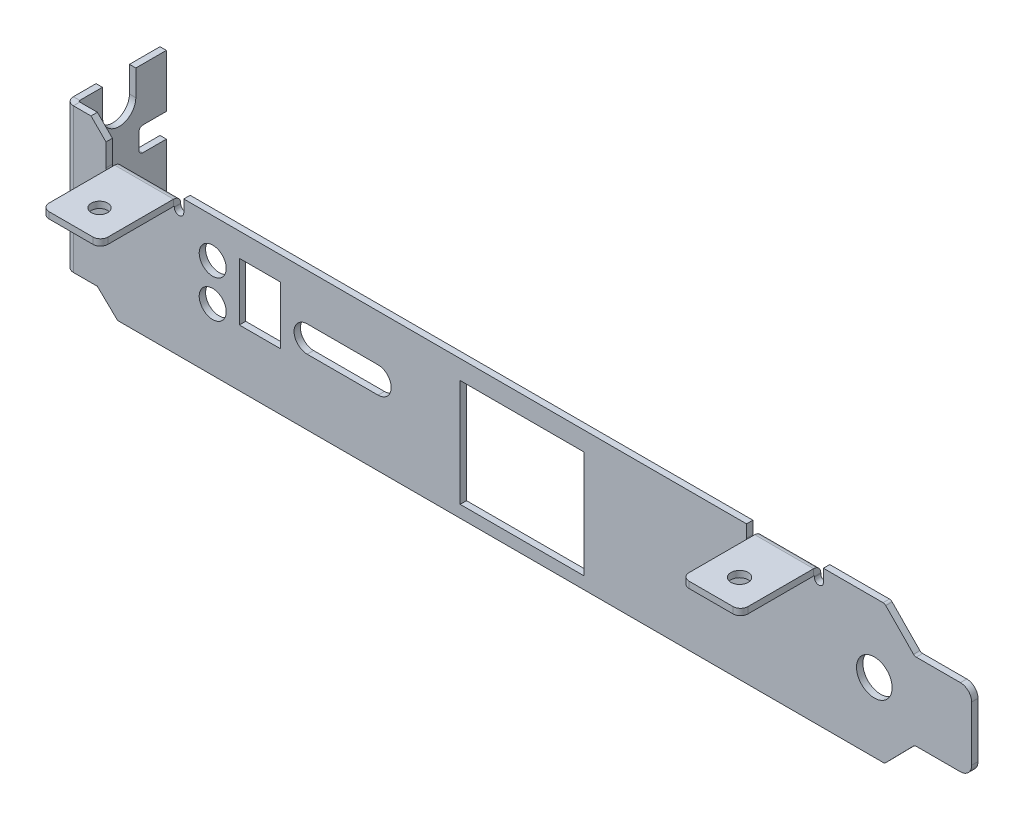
ISO-10303-21;
HEADER;
FILE_DESCRIPTION(('STEP AP214'),'2;1');
FILE_NAME('part.step','',(''),(''),'','','');
FILE_SCHEMA(('AUTOMOTIVE_DESIGN { 1 0 10303 214 1 1 1 1 }'));
ENDSEC;
DATA;
#1=APPLICATION_CONTEXT('core data for automotive mechanical design processes');
#2=APPLICATION_PROTOCOL_DEFINITION('international standard','automotive_design',2000,#1);
#3=PRODUCT_CONTEXT('',#1,'mechanical');
#4=PRODUCT('Part','Part','',(#3));
#5=PRODUCT_RELATED_PRODUCT_CATEGORY('part','',(#4));
#6=PRODUCT_DEFINITION_FORMATION('','',#4);
#7=PRODUCT_DEFINITION_CONTEXT('part definition',#1,'design');
#8=PRODUCT_DEFINITION('design','',#6,#7);
#9=PRODUCT_DEFINITION_SHAPE('','',#8);
#10=(LENGTH_UNIT() NAMED_UNIT(*) SI_UNIT(.MILLI.,.METRE.));
#11=(NAMED_UNIT(*) PLANE_ANGLE_UNIT() SI_UNIT($,.RADIAN.));
#12=(NAMED_UNIT(*) SI_UNIT($,.STERADIAN.) SOLID_ANGLE_UNIT());
#13=UNCERTAINTY_MEASURE_WITH_UNIT(LENGTH_MEASURE(1.E-05),#10,'distance_accuracy_value','');
#14=(GEOMETRIC_REPRESENTATION_CONTEXT(3) GLOBAL_UNCERTAINTY_ASSIGNED_CONTEXT((#13)) GLOBAL_UNIT_ASSIGNED_CONTEXT((#10,
#11,#12)) REPRESENTATION_CONTEXT('',''));
#15=CARTESIAN_POINT('',(0.,0.,0.));
#16=DIRECTION('',(0.,0.,1.));
#17=DIRECTION('',(1.,0.,0.));
#18=AXIS2_PLACEMENT_3D('',#15,#16,#17);
#19=CARTESIAN_POINT('',(-60.8499999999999,12.6,-11.75));
#20=DIRECTION('',(0.,-1.,0.));
#21=DIRECTION('',(0.,0.,-1.));
#22=AXIS2_PLACEMENT_3D('',#19,#20,#21);
#23=PLANE('',#22);
#24=DIRECTION('',(0.,0.,-1.));
#25=VECTOR('',#24,1.);
#26=CARTESIAN_POINT('',(-60.8499999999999,12.6,-11.75));
#27=LINE('',#26,#25);
#28=CARTESIAN_POINT('',(-60.8499999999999,12.6,-7.675));
#29=VERTEX_POINT('',#28);
#30=CARTESIAN_POINT('',(-60.8499999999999,12.6,-11.75));
#31=VERTEX_POINT('',#30);
#32=EDGE_CURVE('E779',#29,#31,#27,.T.);
#33=ORIENTED_EDGE('',*,*,#32,.F.);
#34=DIRECTION('',(-1.,0.,0.));
#35=VECTOR('',#34,1.);
#36=CARTESIAN_POINT('',(-50.8499999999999,12.6,-7.67500000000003));
#37=LINE('',#36,#35);
#38=CARTESIAN_POINT('',(-59.9999999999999,12.6,-7.675));
#39=VERTEX_POINT('',#38);
#40=EDGE_CURVE('E561',#39,#29,#37,.T.);
#41=ORIENTED_EDGE('',*,*,#40,.F.);
#42=DIRECTION('',(0.,0.,-1.));
#43=VECTOR('',#42,1.);
#44=CARTESIAN_POINT('',(-59.9999999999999,12.6,-11.75));
#45=LINE('',#44,#43);
#46=CARTESIAN_POINT('',(-59.9999999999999,12.6,-11.75));
#47=VERTEX_POINT('',#46);
#48=EDGE_CURVE('E776',#39,#47,#45,.T.);
#49=ORIENTED_EDGE('',*,*,#48,.T.);
#50=DIRECTION('',(1.,0.,0.));
#51=VECTOR('',#50,1.);
#52=CARTESIAN_POINT('',(-60.8499999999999,12.6,-11.75));
#53=LINE('',#52,#51);
#54=EDGE_CURVE('E799',#31,#47,#53,.T.);
#55=ORIENTED_EDGE('',*,*,#54,.F.);
#56=EDGE_LOOP('',(#33,#41,#49,#55));
#57=FACE_BOUND('',#56,.T.);
#58=ADVANCED_FACE('F91',(#57),#23,.F.);
#59=CARTESIAN_POINT('',(-60.8499999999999,-6.65000000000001,-11.75));
#60=DIRECTION('',(0.,0.,1.));
#61=DIRECTION('',(1.,0.,0.));
#62=AXIS2_PLACEMENT_3D('',#59,#60,#61);
#63=PLANE('',#62);
#64=DIRECTION('',(0.,-1.,0.));
#65=VECTOR('',#64,1.);
#66=CARTESIAN_POINT('',(-59.9999999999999,-6.65000000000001,-11.75));
#67=LINE('',#66,#65);
#68=CARTESIAN_POINT('',(-59.9999999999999,5.54999999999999,-11.75));
#69=VERTEX_POINT('',#68);
#70=EDGE_CURVE('E791',#47,#69,#67,.T.);
#71=ORIENTED_EDGE('',*,*,#70,.T.);
#72=DIRECTION('',(-1.,0.,0.));
#73=VECTOR('',#72,1.);
#74=CARTESIAN_POINT('',(-60.8499999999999,5.54999999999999,-11.75));
#75=LINE('',#74,#73);
#76=CARTESIAN_POINT('',(-60.8499999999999,5.54999999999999,-11.75));
#77=VERTEX_POINT('',#76);
#78=EDGE_CURVE('E1142',#69,#77,#75,.T.);
#79=ORIENTED_EDGE('',*,*,#78,.T.);
#80=DIRECTION('',(0.,-1.,0.));
#81=VECTOR('',#80,1.);
#82=CARTESIAN_POINT('',(-60.8499999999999,-6.65000000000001,-11.75));
#83=LINE('',#82,#81);
#84=EDGE_CURVE('E780',#31,#77,#83,.T.);
#85=ORIENTED_EDGE('',*,*,#84,.F.);
#86=ORIENTED_EDGE('',*,*,#54,.T.);
#87=EDGE_LOOP('',(#71,#79,#85,#86));
#88=FACE_BOUND('',#87,.T.);
#89=ADVANCED_FACE('F1166',(#88),#63,.F.);
#90=CARTESIAN_POINT('',(48.1687365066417,-8.74999999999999,0.85));
#91=DIRECTION('',(0.,0.,1.));
#92=DIRECTION('',(1.,0.,0.));
#93=AXIS2_PLACEMENT_3D('',#90,#91,#92);
#94=PLANE('',#93);
#95=DIRECTION('',(0.,1.,0.));
#96=VECTOR('',#95,1.);
#97=CARTESIAN_POINT('',(8.27856884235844,6.66,0.85));
#98=LINE('',#97,#96);
#99=CARTESIAN_POINT('',(8.27856884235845,-7.64,0.85));
#100=VERTEX_POINT('',#99);
#101=CARTESIAN_POINT('',(8.27856884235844,6.65999999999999,0.85));
#102=VERTEX_POINT('',#101);
#103=EDGE_CURVE('E826',#100,#102,#98,.T.);
#104=ORIENTED_EDGE('',*,*,#103,.F.);
#105=DIRECTION('',(1.,0.,0.));
#106=VECTOR('',#105,1.);
#107=CARTESIAN_POINT('',(8.27856884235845,-7.64,0.85));
#108=LINE('',#107,#106);
#109=CARTESIAN_POINT('',(-8.22143115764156,-7.64000000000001,0.85));
#110=VERTEX_POINT('',#109);
#111=EDGE_CURVE('E829',#110,#100,#108,.T.);
#112=ORIENTED_EDGE('',*,*,#111,.F.);
#113=DIRECTION('',(0.,-1.,0.));
#114=VECTOR('',#113,1.);
#115=CARTESIAN_POINT('',(-8.22143115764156,6.65999999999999,0.85));
#116=LINE('',#115,#114);
#117=CARTESIAN_POINT('',(-8.22143115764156,6.65999999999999,0.85));
#118=VERTEX_POINT('',#117);
#119=EDGE_CURVE('E833',#118,#110,#116,.T.);
#120=ORIENTED_EDGE('',*,*,#119,.F.);
#121=DIRECTION('',(-1.,0.,0.));
#122=VECTOR('',#121,1.);
#123=CARTESIAN_POINT('',(8.27856884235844,6.66,0.85));
#124=LINE('',#123,#122);
#125=EDGE_CURVE('E836',#102,#118,#124,.T.);
#126=ORIENTED_EDGE('',*,*,#125,.F.);
#127=EDGE_LOOP('',(#104,#112,#120,#126));
#128=FACE_BOUND('',#127,.T.);
#129=CARTESIAN_POINT('',(-19.1714311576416,1.25000000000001,0.85));
#130=DIRECTION('',(0.,0.,1.));
#131=DIRECTION('',(1.,0.,0.));
#132=AXIS2_PLACEMENT_3D('',#129,#130,#131);
#133=CIRCLE('',#132,1.75);
#134=CARTESIAN_POINT('',(-19.1714311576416,-0.499999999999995,0.85));
#135=VERTEX_POINT('',#134);
#136=CARTESIAN_POINT('',(-19.1714311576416,3.,0.85));
#137=VERTEX_POINT('',#136);
#138=EDGE_CURVE('E839',#135,#137,#133,.T.);
#139=ORIENTED_EDGE('',*,*,#138,.F.);
#140=DIRECTION('',(1.,0.,0.));
#141=VECTOR('',#140,1.);
#142=CARTESIAN_POINT('',(-19.1714311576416,-0.499999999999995,0.85));
#143=LINE('',#142,#141);
#144=CARTESIAN_POINT('',(-28.6214311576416,-0.499999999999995,0.85));
#145=VERTEX_POINT('',#144);
#146=EDGE_CURVE('E842',#145,#135,#143,.T.);
#147=ORIENTED_EDGE('',*,*,#146,.F.);
#148=CARTESIAN_POINT('',(-28.6214311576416,1.25000000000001,0.85));
#149=DIRECTION('',(0.,0.,1.));
#150=DIRECTION('',(1.,0.,0.));
#151=AXIS2_PLACEMENT_3D('',#148,#149,#150);
#152=CIRCLE('',#151,1.75);
#153=CARTESIAN_POINT('',(-28.6214311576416,3.00000000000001,0.85));
#154=VERTEX_POINT('',#153);
#155=EDGE_CURVE('E845',#154,#145,#152,.T.);
#156=ORIENTED_EDGE('',*,*,#155,.F.);
#157=DIRECTION('',(-1.,0.,0.));
#158=VECTOR('',#157,1.);
#159=CARTESIAN_POINT('',(-19.1714311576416,3.00000000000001,0.85));
#160=LINE('',#159,#158);
#161=EDGE_CURVE('E848',#137,#154,#160,.T.);
#162=ORIENTED_EDGE('',*,*,#161,.F.);
#163=EDGE_LOOP('',(#139,#147,#156,#162));
#164=FACE_BOUND('',#163,.T.);
#165=DIRECTION('',(0.,1.,0.));
#166=VECTOR('',#165,1.);
#167=CARTESIAN_POINT('',(-32.1714311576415,6.04999999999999,0.85));
#168=LINE('',#167,#166);
#169=CARTESIAN_POINT('',(-32.1714311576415,-1.65,0.85));
#170=VERTEX_POINT('',#169);
#171=CARTESIAN_POINT('',(-32.1714311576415,6.04999999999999,0.85));
#172=VERTEX_POINT('',#171);
#173=EDGE_CURVE('E851',#170,#172,#168,.T.);
#174=ORIENTED_EDGE('',*,*,#173,.F.);
#175=DIRECTION('',(1.,0.,0.));
#176=VECTOR('',#175,1.);
#177=CARTESIAN_POINT('',(-32.1714311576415,-1.65,0.85));
#178=LINE('',#177,#176);
#179=CARTESIAN_POINT('',(-37.6714311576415,-1.65000000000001,0.85));
#180=VERTEX_POINT('',#179);
#181=EDGE_CURVE('E854',#180,#170,#178,.T.);
#182=ORIENTED_EDGE('',*,*,#181,.F.);
#183=DIRECTION('',(0.,-1.,0.));
#184=VECTOR('',#183,1.);
#185=CARTESIAN_POINT('',(-37.6714311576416,6.04999999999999,0.85));
#186=LINE('',#185,#184);
#187=CARTESIAN_POINT('',(-37.6714311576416,6.04999999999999,0.85));
#188=VERTEX_POINT('',#187);
#189=EDGE_CURVE('E857',#188,#180,#186,.T.);
#190=ORIENTED_EDGE('',*,*,#189,.F.);
#191=DIRECTION('',(-1.,0.,0.));
#192=VECTOR('',#191,1.);
#193=CARTESIAN_POINT('',(-32.1714311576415,6.04999999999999,0.85));
#194=LINE('',#193,#192);
#195=EDGE_CURVE('E860',#172,#188,#194,.T.);
#196=ORIENTED_EDGE('',*,*,#195,.F.);
#197=EDGE_LOOP('',(#174,#182,#190,#196));
#198=FACE_BOUND('',#197,.T.);
#199=CARTESIAN_POINT('',(-41.2214311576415,4.00000000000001,0.85));
#200=DIRECTION('',(0.,0.,1.));
#201=DIRECTION('',(1.,0.,0.));
#202=AXIS2_PLACEMENT_3D('',#199,#200,#201);
#203=CIRCLE('',#202,1.8);
#204=CARTESIAN_POINT('',(-39.4214311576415,4.00000000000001,0.85));
#205=VERTEX_POINT('',#204);
#206=EDGE_CURVE('E863',#205,#205,#203,.T.);
#207=ORIENTED_EDGE('',*,*,#206,.F.);
#208=EDGE_LOOP('',(#207));
#209=FACE_BOUND('',#208,.T.);
#210=CARTESIAN_POINT('',(-41.2214311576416,-0.999999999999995,0.85));
#211=DIRECTION('',(0.,0.,1.));
#212=DIRECTION('',(1.,0.,0.));
#213=AXIS2_PLACEMENT_3D('',#210,#211,#212);
#214=CIRCLE('',#213,1.8);
#215=CARTESIAN_POINT('',(-39.4214311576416,-0.999999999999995,0.85));
#216=VERTEX_POINT('',#215);
#217=EDGE_CURVE('E866',#216,#216,#214,.T.);
#218=ORIENTED_EDGE('',*,*,#217,.F.);
#219=EDGE_LOOP('',(#218));
#220=FACE_BOUND('',#219,.T.);
#221=CARTESIAN_POINT('',(47.0035707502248,-0.0150000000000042,0.85));
#222=DIRECTION('',(0.,0.,1.));
#223=DIRECTION('',(1.,0.,0.));
#224=AXIS2_PLACEMENT_3D('',#221,#222,#223);
#225=CIRCLE('',#224,2.37500000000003);
#226=CARTESIAN_POINT('',(49.3785707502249,-0.0150000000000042,0.85));
#227=VERTEX_POINT('',#226);
#228=EDGE_CURVE('E869',#227,#227,#225,.T.);
#229=ORIENTED_EDGE('',*,*,#228,.F.);
#230=EDGE_LOOP('',(#229));
#231=FACE_BOUND('',#230,.T.);
#232=CARTESIAN_POINT('',(30.5600000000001,7.55,0.849999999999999));
#233=DIRECTION('',(0.,0.,1.));
#234=DIRECTION('',(1.,0.,0.));
#235=AXIS2_PLACEMENT_3D('',#232,#233,#234);
#236=CIRCLE('',#235,0.6);
#237=CARTESIAN_POINT('',(29.9600000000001,7.55,0.849999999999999));
#238=VERTEX_POINT('',#237);
#239=CARTESIAN_POINT('',(31.1600000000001,7.55,0.849999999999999));
#240=VERTEX_POINT('',#239);
#241=EDGE_CURVE('E653',#238,#240,#236,.T.);
#242=ORIENTED_EDGE('',*,*,#241,.F.);
#243=DIRECTION('',(0.,-1.,0.));
#244=VECTOR('',#243,1.);
#245=CARTESIAN_POINT('',(29.9600000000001,9.2,0.849999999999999));
#246=LINE('',#245,#244);
#247=CARTESIAN_POINT('',(29.9600000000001,9.2,0.849999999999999));
#248=VERTEX_POINT('',#247);
#249=EDGE_CURVE('E648',#248,#238,#246,.T.);
#250=ORIENTED_EDGE('',*,*,#249,.F.);
#251=DIRECTION('',(-1.,0.,0.));
#252=VECTOR('',#251,1.);
#253=CARTESIAN_POINT('',(48.1687365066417,9.2,0.85));
#254=LINE('',#253,#252);
#255=CARTESIAN_POINT('',(-45.0799999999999,9.19999999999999,0.85));
#256=VERTEX_POINT('',#255);
#257=EDGE_CURVE('E913',#248,#256,#254,.T.);
#258=ORIENTED_EDGE('',*,*,#257,.T.);
#259=DIRECTION('',(0.,1.,0.));
#260=VECTOR('',#259,1.);
#261=CARTESIAN_POINT('',(-45.0799999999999,7.59999999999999,0.849999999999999));
#262=LINE('',#261,#260);
#263=CARTESIAN_POINT('',(-45.0799999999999,7.59999999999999,0.85));
#264=VERTEX_POINT('',#263);
#265=EDGE_CURVE('E750',#264,#256,#262,.T.);
#266=ORIENTED_EDGE('',*,*,#265,.F.);
#267=CARTESIAN_POINT('',(-45.7099999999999,7.59999999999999,0.849999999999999));
#268=DIRECTION('',(0.,0.,1.));
#269=DIRECTION('',(1.,0.,0.));
#270=AXIS2_PLACEMENT_3D('',#267,#268,#269);
#271=CIRCLE('',#270,0.629999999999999);
#272=CARTESIAN_POINT('',(-46.3399999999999,7.6,0.85));
#273=VERTEX_POINT('',#272);
#274=EDGE_CURVE('E746',#273,#264,#271,.T.);
#275=ORIENTED_EDGE('',*,*,#274,.F.);
#276=DIRECTION('',(0.,-1.,0.));
#277=VECTOR('',#276,1.);
#278=CARTESIAN_POINT('',(-46.3399999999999,7.64999999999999,0.849999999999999));
#279=LINE('',#278,#277);
#280=CARTESIAN_POINT('',(-46.3399999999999,7.65,0.85));
#281=VERTEX_POINT('',#280);
#282=EDGE_CURVE('E743',#281,#273,#279,.T.);
#283=ORIENTED_EDGE('',*,*,#282,.F.);
#284=DIRECTION('',(-1.,0.,0.));
#285=VECTOR('',#284,1.);
#286=CARTESIAN_POINT('',(-54.1899999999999,7.64999999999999,0.849999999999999));
#287=LINE('',#286,#285);
#288=CARTESIAN_POINT('',(-54.1899999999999,7.64999999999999,0.85));
#289=VERTEX_POINT('',#288);
#290=EDGE_CURVE('E724',#289,#281,#287,.F.);
#291=ORIENTED_EDGE('',*,*,#290,.F.);
#292=DIRECTION('',(0.,1.,0.));
#293=VECTOR('',#292,1.);
#294=CARTESIAN_POINT('',(-54.1899999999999,7.59999999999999,0.849999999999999));
#295=LINE('',#294,#293);
#296=CARTESIAN_POINT('',(-54.1899999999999,7.59999999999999,0.85));
#297=VERTEX_POINT('',#296);
#298=EDGE_CURVE('E739',#297,#289,#295,.T.);
#299=ORIENTED_EDGE('',*,*,#298,.F.);
#300=CARTESIAN_POINT('',(-54.8199999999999,7.59999999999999,0.849999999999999));
#301=DIRECTION('',(0.,0.,1.));
#302=DIRECTION('',(1.,0.,0.));
#303=AXIS2_PLACEMENT_3D('',#300,#301,#302);
#304=CIRCLE('',#303,0.629999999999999);
#305=CARTESIAN_POINT('',(-55.4499999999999,7.6,0.85));
#306=VERTEX_POINT('',#305);
#307=EDGE_CURVE('E734',#306,#297,#304,.T.);
#308=ORIENTED_EDGE('',*,*,#307,.F.);
#309=DIRECTION('',(0.,1.,0.));
#310=VECTOR('',#309,1.);
#311=CARTESIAN_POINT('',(-55.4499999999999,9.19999999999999,0.85));
#312=LINE('',#311,#310);
#313=CARTESIAN_POINT('',(-55.4499999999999,10.6,0.85));
#314=VERTEX_POINT('',#313);
#315=EDGE_CURVE('E917',#306,#314,#312,.T.);
#316=ORIENTED_EDGE('',*,*,#315,.T.);
#317=DIRECTION('',(-0.707106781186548,0.707106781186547,0.));
#318=VECTOR('',#317,1.);
#319=CARTESIAN_POINT('',(-57.4499999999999,12.6,0.85));
#320=LINE('',#319,#318);
#321=CARTESIAN_POINT('',(-57.4499999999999,12.6,0.85));
#322=VERTEX_POINT('',#321);
#323=EDGE_CURVE('E920',#314,#322,#320,.T.);
#324=ORIENTED_EDGE('',*,*,#323,.T.);
#325=DIRECTION('',(-1.,0.,0.));
#326=VECTOR('',#325,1.);
#327=CARTESIAN_POINT('',(-59.9999999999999,12.6,0.85));
#328=LINE('',#327,#326);
#329=CARTESIAN_POINT('',(-59.7999999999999,12.6,0.849999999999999));
#330=VERTEX_POINT('',#329);
#331=EDGE_CURVE('E923',#322,#330,#328,.T.);
#332=ORIENTED_EDGE('',*,*,#331,.T.);
#333=DIRECTION('',(0.,1.,0.));
#334=VECTOR('',#333,1.);
#335=CARTESIAN_POINT('',(-59.7999999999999,12.6,0.849999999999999));
#336=LINE('',#335,#334);
#337=CARTESIAN_POINT('',(-59.7999999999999,-6.65000000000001,0.85));
#338=VERTEX_POINT('',#337);
#339=EDGE_CURVE('E803',#330,#338,#336,.F.);
#340=ORIENTED_EDGE('',*,*,#339,.T.);
#341=DIRECTION('',(1.,0.,0.));
#342=VECTOR('',#341,1.);
#343=CARTESIAN_POINT('',(-59.9999999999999,-6.65000000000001,0.85));
#344=LINE('',#343,#342);
#345=CARTESIAN_POINT('',(-56.5999999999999,-6.65000000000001,0.85));
#346=VERTEX_POINT('',#345);
#347=EDGE_CURVE('E872',#338,#346,#344,.T.);
#348=ORIENTED_EDGE('',*,*,#347,.T.);
#349=DIRECTION('',(0.720320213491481,-0.69364168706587,0.));
#350=VECTOR('',#349,1.);
#351=CARTESIAN_POINT('',(-56.5999999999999,-6.65000000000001,0.85));
#352=LINE('',#351,#350);
#353=CARTESIAN_POINT('',(-53.8999999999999,-9.25000000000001,0.85));
#354=VERTEX_POINT('',#353);
#355=EDGE_CURVE('E874',#346,#354,#352,.T.);
#356=ORIENTED_EDGE('',*,*,#355,.T.);
#357=DIRECTION('',(1.,0.,0.));
#358=VECTOR('',#357,1.);
#359=CARTESIAN_POINT('',(48.1687365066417,-9.24999999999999,0.85));
#360=LINE('',#359,#358);
#361=CARTESIAN_POINT('',(48.1687365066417,-9.24999999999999,0.85));
#362=VERTEX_POINT('',#361);
#363=EDGE_CURVE('E877',#354,#362,#360,.T.);
#364=ORIENTED_EDGE('',*,*,#363,.T.);
#365=CARTESIAN_POINT('',(48.1687365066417,-8.74999999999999,0.85));
#366=DIRECTION('',(0.,0.,1.));
#367=DIRECTION('',(1.,0.,0.));
#368=AXIS2_PLACEMENT_3D('',#365,#366,#367);
#369=CIRCLE('',#368,0.499999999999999);
#370=CARTESIAN_POINT('',(48.5255582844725,-9.10025450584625,0.85));
#371=VERTEX_POINT('',#370);
#372=EDGE_CURVE('E880',#362,#371,#369,.T.);
#373=ORIENTED_EDGE('',*,*,#372,.T.);
#374=DIRECTION('',(0.700509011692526,0.713643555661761,0.));
#375=VECTOR('',#374,1.);
#376=CARTESIAN_POINT('',(48.5255582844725,-9.10025450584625,0.85));
#377=LINE('',#376,#375);
#378=CARTESIAN_POINT('',(52.2315794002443,-5.32474549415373,0.85));
#379=VERTEX_POINT('',#378);
#380=EDGE_CURVE('E883',#371,#379,#377,.T.);
#381=ORIENTED_EDGE('',*,*,#380,.T.);
#382=CARTESIAN_POINT('',(52.5884011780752,-5.67499999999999,0.85));
#383=DIRECTION('',(0.,0.,-1.));
#384=DIRECTION('',(1.,0.,0.));
#385=AXIS2_PLACEMENT_3D('',#382,#383,#384);
#386=CIRCLE('',#385,0.500000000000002);
#387=CARTESIAN_POINT('',(52.5884011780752,-5.17499999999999,0.85));
#388=VERTEX_POINT('',#387);
#389=EDGE_CURVE('E886',#379,#388,#386,.T.);
#390=ORIENTED_EDGE('',*,*,#389,.T.);
#391=DIRECTION('',(1.,0.,0.));
#392=VECTOR('',#391,1.);
#393=CARTESIAN_POINT('',(52.5884011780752,-5.17499999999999,0.85));
#394=LINE('',#393,#392);
#395=CARTESIAN_POINT('',(58.4785688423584,-5.17499999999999,0.85));
#396=VERTEX_POINT('',#395);
#397=EDGE_CURVE('E889',#388,#396,#394,.T.);
#398=ORIENTED_EDGE('',*,*,#397,.T.);
#399=CARTESIAN_POINT('',(58.4785688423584,-3.67499999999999,0.85));
#400=DIRECTION('',(0.,0.,1.));
#401=DIRECTION('',(1.,0.,0.));
#402=AXIS2_PLACEMENT_3D('',#399,#400,#401);
#403=CIRCLE('',#402,1.5);
#404=CARTESIAN_POINT('',(59.9785688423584,-3.67499999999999,0.85));
#405=VERTEX_POINT('',#404);
#406=EDGE_CURVE('E892',#396,#405,#403,.T.);
#407=ORIENTED_EDGE('',*,*,#406,.T.);
#408=DIRECTION('',(0.,1.,0.));
#409=VECTOR('',#408,1.);
#410=CARTESIAN_POINT('',(59.9785688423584,-3.67499999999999,0.85));
#411=LINE('',#410,#409);
#412=CARTESIAN_POINT('',(59.9785688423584,3.6309274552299,0.85));
#413=VERTEX_POINT('',#412);
#414=EDGE_CURVE('E895',#405,#413,#411,.T.);
#415=ORIENTED_EDGE('',*,*,#414,.T.);
#416=CARTESIAN_POINT('',(58.4844962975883,3.6309274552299,0.85));
#417=DIRECTION('',(0.,0.,1.));
#418=DIRECTION('',(-1.,0.,0.));
#419=AXIS2_PLACEMENT_3D('',#416,#417,#418);
#420=CIRCLE('',#419,1.4940725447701);
#421=CARTESIAN_POINT('',(58.4844962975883,5.12500000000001,0.85));
#422=VERTEX_POINT('',#421);
#423=EDGE_CURVE('E898',#413,#422,#420,.T.);
#424=ORIENTED_EDGE('',*,*,#423,.T.);
#425=DIRECTION('',(-1.,0.,0.));
#426=VECTOR('',#425,1.);
#427=CARTESIAN_POINT('',(58.4844962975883,5.12500000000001,0.85));
#428=LINE('',#427,#426);
#429=CARTESIAN_POINT('',(52.5884011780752,5.125,0.85));
#430=VERTEX_POINT('',#429);
#431=EDGE_CURVE('E901',#422,#430,#428,.T.);
#432=ORIENTED_EDGE('',*,*,#431,.T.);
#433=CARTESIAN_POINT('',(52.5884011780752,5.62500000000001,0.85));
#434=DIRECTION('',(0.,0.,-1.));
#435=DIRECTION('',(-1.,0.,0.));
#436=AXIS2_PLACEMENT_3D('',#433,#434,#435);
#437=CIRCLE('',#436,0.500000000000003);
#438=CARTESIAN_POINT('',(52.2315794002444,5.27474549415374,0.85));
#439=VERTEX_POINT('',#438);
#440=EDGE_CURVE('E904',#430,#439,#437,.T.);
#441=ORIENTED_EDGE('',*,*,#440,.T.);
#442=DIRECTION('',(-0.700509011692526,0.713643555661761,0.));
#443=VECTOR('',#442,1.);
#444=CARTESIAN_POINT('',(52.2315794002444,5.27474549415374,0.85));
#445=LINE('',#444,#443);
#446=CARTESIAN_POINT('',(48.5255582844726,9.05025450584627,0.85));
#447=VERTEX_POINT('',#446);
#448=EDGE_CURVE('E907',#439,#447,#445,.T.);
#449=ORIENTED_EDGE('',*,*,#448,.T.);
#450=CARTESIAN_POINT('',(48.1687365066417,8.7,0.85));
#451=DIRECTION('',(0.,0.,1.));
#452=DIRECTION('',(-1.,0.,0.));
#453=AXIS2_PLACEMENT_3D('',#450,#451,#452);
#454=CIRCLE('',#453,0.500000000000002);
#455=CARTESIAN_POINT('',(48.1687365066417,9.2,0.85));
#456=VERTEX_POINT('',#455);
#457=EDGE_CURVE('E910',#447,#456,#454,.T.);
#458=ORIENTED_EDGE('',*,*,#457,.T.);
#459=CARTESIAN_POINT('',(40.2100000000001,9.2,0.85));
#460=VERTEX_POINT('',#459);
#461=EDGE_CURVE('E914',#456,#460,#254,.T.);
#462=ORIENTED_EDGE('',*,*,#461,.T.);
#463=DIRECTION('',(0.,1.,0.));
#464=VECTOR('',#463,1.);
#465=CARTESIAN_POINT('',(40.2100000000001,7.55,0.849999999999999));
#466=LINE('',#465,#464);
#467=CARTESIAN_POINT('',(40.2100000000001,7.55,0.849999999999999));
#468=VERTEX_POINT('',#467);
#469=EDGE_CURVE('E667',#468,#460,#466,.T.);
#470=ORIENTED_EDGE('',*,*,#469,.F.);
#471=CARTESIAN_POINT('',(39.6100000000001,7.55,0.849999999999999));
#472=DIRECTION('',(0.,0.,1.));
#473=DIRECTION('',(1.,0.,0.));
#474=AXIS2_PLACEMENT_3D('',#471,#472,#473);
#475=CIRCLE('',#474,0.6);
#476=CARTESIAN_POINT('',(39.0100000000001,7.55,0.849999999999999));
#477=VERTEX_POINT('',#476);
#478=EDGE_CURVE('E663',#477,#468,#475,.T.);
#479=ORIENTED_EDGE('',*,*,#478,.F.);
#480=DIRECTION('',(0.,-1.,0.));
#481=VECTOR('',#480,1.);
#482=CARTESIAN_POINT('',(39.0100000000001,7.65,0.849999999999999));
#483=LINE('',#482,#481);
#484=CARTESIAN_POINT('',(39.0100000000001,7.65,0.849999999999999));
#485=VERTEX_POINT('',#484);
#486=EDGE_CURVE('E660',#485,#477,#483,.T.);
#487=ORIENTED_EDGE('',*,*,#486,.F.);
#488=DIRECTION('',(-1.,0.,0.));
#489=VECTOR('',#488,1.);
#490=CARTESIAN_POINT('',(31.1600000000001,7.65,0.849999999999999));
#491=LINE('',#490,#489);
#492=CARTESIAN_POINT('',(31.1600000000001,7.65,0.849999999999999));
#493=VERTEX_POINT('',#492);
#494=EDGE_CURVE('E637',#493,#485,#491,.F.);
#495=ORIENTED_EDGE('',*,*,#494,.F.);
#496=DIRECTION('',(0.,1.,0.));
#497=VECTOR('',#496,1.);
#498=CARTESIAN_POINT('',(31.1600000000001,7.55,0.849999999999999));
#499=LINE('',#498,#497);
#500=EDGE_CURVE('E657',#240,#493,#499,.T.);
#501=ORIENTED_EDGE('',*,*,#500,.F.);
#502=EDGE_LOOP('',(#242,#250,#258,#266,#275,#283,#291,#299,#308,#316,#324,#332,#340,#348,#356,
#364,#373,#381,#390,#398,#407,#415,#424,#432,#441,#449,#458,#462,#470,#479,#487,#495,#501));
#503=FACE_BOUND('',#502,.T.);
#504=ADVANCED_FACE('F1224',(#128,#164,#198,#209,#220,#231,#503),#94,.T.);
#505=CARTESIAN_POINT('',(48.1687365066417,-8.74999999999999,0.));
#506=DIRECTION('',(0.,0.,1.));
#507=DIRECTION('',(1.,0.,0.));
#508=AXIS2_PLACEMENT_3D('',#505,#506,#507);
#509=PLANE('',#508);
#510=CARTESIAN_POINT('',(47.0035707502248,-0.0150000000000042,0.));
#511=DIRECTION('',(0.,0.,1.));
#512=DIRECTION('',(1.,0.,0.));
#513=AXIS2_PLACEMENT_3D('',#510,#511,#512);
#514=CIRCLE('',#513,2.37500000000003);
#515=CARTESIAN_POINT('',(49.3785707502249,-0.0150000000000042,0.));
#516=VERTEX_POINT('',#515);
#517=EDGE_CURVE('E968',#516,#516,#514,.T.);
#518=ORIENTED_EDGE('',*,*,#517,.T.);
#519=EDGE_LOOP('',(#518));
#520=FACE_BOUND('',#519,.T.);
#521=CARTESIAN_POINT('',(-41.2214311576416,-0.999999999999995,0.));
#522=DIRECTION('',(0.,0.,1.));
#523=DIRECTION('',(1.,0.,0.));
#524=AXIS2_PLACEMENT_3D('',#521,#522,#523);
#525=CIRCLE('',#524,1.8);
#526=CARTESIAN_POINT('',(-39.4214311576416,-0.999999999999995,0.));
#527=VERTEX_POINT('',#526);
#528=EDGE_CURVE('E965',#527,#527,#525,.T.);
#529=ORIENTED_EDGE('',*,*,#528,.T.);
#530=EDGE_LOOP('',(#529));
#531=FACE_BOUND('',#530,.T.);
#532=CARTESIAN_POINT('',(-41.2214311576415,4.00000000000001,0.));
#533=DIRECTION('',(0.,0.,1.));
#534=DIRECTION('',(1.,0.,0.));
#535=AXIS2_PLACEMENT_3D('',#532,#533,#534);
#536=CIRCLE('',#535,1.8);
#537=CARTESIAN_POINT('',(-39.4214311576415,4.00000000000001,0.));
#538=VERTEX_POINT('',#537);
#539=EDGE_CURVE('E957',#538,#538,#536,.T.);
#540=ORIENTED_EDGE('',*,*,#539,.T.);
#541=EDGE_LOOP('',(#540));
#542=FACE_BOUND('',#541,.T.);
#543=DIRECTION('',(0.,1.,0.));
#544=VECTOR('',#543,1.);
#545=CARTESIAN_POINT('',(-32.1714311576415,-8.74999999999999,0.));
#546=LINE('',#545,#544);
#547=CARTESIAN_POINT('',(-32.1714311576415,-1.65,0.));
#548=VERTEX_POINT('',#547);
#549=CARTESIAN_POINT('',(-32.1714311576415,6.04999999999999,0.));
#550=VERTEX_POINT('',#549);
#551=EDGE_CURVE('E945',#548,#550,#546,.T.);
#552=ORIENTED_EDGE('',*,*,#551,.T.);
#553=DIRECTION('',(1.,0.,0.));
#554=VECTOR('',#553,1.);
#555=CARTESIAN_POINT('',(48.1687365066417,6.04999999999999,0.));
#556=LINE('',#555,#554);
#557=CARTESIAN_POINT('',(-37.6714311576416,6.04999999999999,0.));
#558=VERTEX_POINT('',#557);
#559=EDGE_CURVE('E954',#550,#558,#556,.F.);
#560=ORIENTED_EDGE('',*,*,#559,.T.);
#561=DIRECTION('',(0.,1.,0.));
#562=VECTOR('',#561,1.);
#563=CARTESIAN_POINT('',(-37.6714311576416,-8.74999999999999,0.));
#564=LINE('',#563,#562);
#565=CARTESIAN_POINT('',(-37.6714311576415,-1.65000000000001,0.));
#566=VERTEX_POINT('',#565);
#567=EDGE_CURVE('E958',#558,#566,#564,.F.);
#568=ORIENTED_EDGE('',*,*,#567,.T.);
#569=DIRECTION('',(1.,0.,0.));
#570=VECTOR('',#569,1.);
#571=CARTESIAN_POINT('',(48.1687365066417,-1.65000000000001,0.));
#572=LINE('',#571,#570);
#573=EDGE_CURVE('E953',#566,#548,#572,.T.);
#574=ORIENTED_EDGE('',*,*,#573,.T.);
#575=EDGE_LOOP('',(#552,#560,#568,#574));
#576=FACE_BOUND('',#575,.T.);
#577=CARTESIAN_POINT('',(-19.1714311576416,1.25000000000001,0.));
#578=DIRECTION('',(0.,0.,1.));
#579=DIRECTION('',(1.,0.,0.));
#580=AXIS2_PLACEMENT_3D('',#577,#578,#579);
#581=CIRCLE('',#580,1.75);
#582=CARTESIAN_POINT('',(-19.1714311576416,-0.499999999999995,0.));
#583=VERTEX_POINT('',#582);
#584=CARTESIAN_POINT('',(-19.1714311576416,3.,0.));
#585=VERTEX_POINT('',#584);
#586=EDGE_CURVE('E933',#583,#585,#581,.T.);
#587=ORIENTED_EDGE('',*,*,#586,.T.);
#588=DIRECTION('',(1.,0.,0.));
#589=VECTOR('',#588,1.);
#590=CARTESIAN_POINT('',(48.1687365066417,3.,0.));
#591=LINE('',#590,#589);
#592=CARTESIAN_POINT('',(-28.6214311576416,3.,0.));
#593=VERTEX_POINT('',#592);
#594=EDGE_CURVE('E942',#585,#593,#591,.F.);
#595=ORIENTED_EDGE('',*,*,#594,.T.);
#596=CARTESIAN_POINT('',(-28.6214311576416,1.25000000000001,0.));
#597=DIRECTION('',(0.,0.,1.));
#598=DIRECTION('',(1.,0.,0.));
#599=AXIS2_PLACEMENT_3D('',#596,#597,#598);
#600=CIRCLE('',#599,1.75);
#601=CARTESIAN_POINT('',(-28.6214311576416,-0.499999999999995,0.));
#602=VERTEX_POINT('',#601);
#603=EDGE_CURVE('E946',#593,#602,#600,.T.);
#604=ORIENTED_EDGE('',*,*,#603,.T.);
#605=DIRECTION('',(1.,0.,0.));
#606=VECTOR('',#605,1.);
#607=CARTESIAN_POINT('',(48.1687365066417,-0.499999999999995,0.));
#608=LINE('',#607,#606);
#609=EDGE_CURVE('E941',#602,#583,#608,.T.);
#610=ORIENTED_EDGE('',*,*,#609,.T.);
#611=EDGE_LOOP('',(#587,#595,#604,#610));
#612=FACE_BOUND('',#611,.T.);
#613=DIRECTION('',(0.,1.,0.));
#614=VECTOR('',#613,1.);
#615=CARTESIAN_POINT('',(8.27856884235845,-8.74999999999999,0.));
#616=LINE('',#615,#614);
#617=CARTESIAN_POINT('',(8.27856884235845,-7.64,0.));
#618=VERTEX_POINT('',#617);
#619=CARTESIAN_POINT('',(8.27856884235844,6.65999999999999,0.));
#620=VERTEX_POINT('',#619);
#621=EDGE_CURVE('E823',#618,#620,#616,.T.);
#622=ORIENTED_EDGE('',*,*,#621,.T.);
#623=DIRECTION('',(1.,0.,0.));
#624=VECTOR('',#623,1.);
#625=CARTESIAN_POINT('',(48.1687365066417,6.65999999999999,0.));
#626=LINE('',#625,#624);
#627=CARTESIAN_POINT('',(-8.22143115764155,6.65999999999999,0.));
#628=VERTEX_POINT('',#627);
#629=EDGE_CURVE('E930',#620,#628,#626,.F.);
#630=ORIENTED_EDGE('',*,*,#629,.T.);
#631=DIRECTION('',(0.,1.,0.));
#632=VECTOR('',#631,1.);
#633=CARTESIAN_POINT('',(-8.22143115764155,-8.74999999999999,0.));
#634=LINE('',#633,#632);
#635=CARTESIAN_POINT('',(-8.22143115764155,-7.64000000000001,0.));
#636=VERTEX_POINT('',#635);
#637=EDGE_CURVE('E934',#628,#636,#634,.F.);
#638=ORIENTED_EDGE('',*,*,#637,.T.);
#639=DIRECTION('',(1.,0.,0.));
#640=VECTOR('',#639,1.);
#641=CARTESIAN_POINT('',(48.1687365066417,-7.64000000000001,0.));
#642=LINE('',#641,#640);
#643=EDGE_CURVE('E929',#636,#618,#642,.T.);
#644=ORIENTED_EDGE('',*,*,#643,.T.);
#645=EDGE_LOOP('',(#622,#630,#638,#644));
#646=FACE_BOUND('',#645,.T.);
#647=DIRECTION('',(0.,1.,0.));
#648=VECTOR('',#647,1.);
#649=CARTESIAN_POINT('',(29.9600000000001,-8.74999999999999,0.));
#650=LINE('',#649,#648);
#651=CARTESIAN_POINT('',(29.9600000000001,7.55000000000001,0.));
#652=VERTEX_POINT('',#651);
#653=CARTESIAN_POINT('',(29.9600000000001,9.20000000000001,0.));
#654=VERTEX_POINT('',#653);
#655=EDGE_CURVE('E682',#652,#654,#650,.T.);
#656=ORIENTED_EDGE('',*,*,#655,.F.);
#657=CARTESIAN_POINT('',(30.5600000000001,7.55000000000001,0.));
#658=DIRECTION('',(0.,0.,1.));
#659=DIRECTION('',(1.,0.,0.));
#660=AXIS2_PLACEMENT_3D('',#657,#658,#659);
#661=CIRCLE('',#660,0.6);
#662=CARTESIAN_POINT('',(31.1600000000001,7.55000000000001,0.));
#663=VERTEX_POINT('',#662);
#664=EDGE_CURVE('E1098',#663,#652,#661,.F.);
#665=ORIENTED_EDGE('',*,*,#664,.F.);
#666=DIRECTION('',(0.,-1.,0.));
#667=VECTOR('',#666,1.);
#668=CARTESIAN_POINT('',(31.1600000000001,-8.74999999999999,0.));
#669=LINE('',#668,#667);
#670=CARTESIAN_POINT('',(31.1600000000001,7.65,0.));
#671=VERTEX_POINT('',#670);
#672=EDGE_CURVE('E1096',#671,#663,#669,.T.);
#673=ORIENTED_EDGE('',*,*,#672,.F.);
#674=DIRECTION('',(-1.,0.,0.));
#675=VECTOR('',#674,1.);
#676=CARTESIAN_POINT('',(31.1600000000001,7.65,0.));
#677=LINE('',#676,#675);
#678=CARTESIAN_POINT('',(39.0100000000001,7.65000000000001,0.));
#679=VERTEX_POINT('',#678);
#680=EDGE_CURVE('E624',#671,#679,#677,.F.);
#681=ORIENTED_EDGE('',*,*,#680,.T.);
#682=DIRECTION('',(0.,1.,0.));
#683=VECTOR('',#682,1.);
#684=CARTESIAN_POINT('',(39.0100000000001,-8.74999999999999,0.));
#685=LINE('',#684,#683);
#686=CARTESIAN_POINT('',(39.0100000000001,7.55000000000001,0.));
#687=VERTEX_POINT('',#686);
#688=EDGE_CURVE('E1094',#687,#679,#685,.T.);
#689=ORIENTED_EDGE('',*,*,#688,.F.);
#690=CARTESIAN_POINT('',(39.6100000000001,7.55000000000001,0.));
#691=DIRECTION('',(0.,0.,1.));
#692=DIRECTION('',(1.,0.,0.));
#693=AXIS2_PLACEMENT_3D('',#690,#691,#692);
#694=CIRCLE('',#693,0.6);
#695=CARTESIAN_POINT('',(40.2100000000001,7.55000000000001,0.));
#696=VERTEX_POINT('',#695);
#697=EDGE_CURVE('E1092',#696,#687,#694,.F.);
#698=ORIENTED_EDGE('',*,*,#697,.F.);
#699=DIRECTION('',(0.,-1.,0.));
#700=VECTOR('',#699,1.);
#701=CARTESIAN_POINT('',(40.2100000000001,-8.74999999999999,0.));
#702=LINE('',#701,#700);
#703=CARTESIAN_POINT('',(40.2100000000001,9.20000000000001,0.));
#704=VERTEX_POINT('',#703);
#705=EDGE_CURVE('E651',#704,#696,#702,.T.);
#706=ORIENTED_EDGE('',*,*,#705,.F.);
#707=DIRECTION('',(1.,0.,0.));
#708=VECTOR('',#707,1.);
#709=CARTESIAN_POINT('',(48.1687365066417,9.2,0.));
#710=LINE('',#709,#708);
#711=CARTESIAN_POINT('',(48.1687365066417,9.2,0.));
#712=VERTEX_POINT('',#711);
#713=EDGE_CURVE('E982',#712,#704,#710,.F.);
#714=ORIENTED_EDGE('',*,*,#713,.F.);
#715=CARTESIAN_POINT('',(48.1687365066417,8.7,0.));
#716=DIRECTION('',(0.,0.,1.));
#717=DIRECTION('',(1.,0.,0.));
#718=AXIS2_PLACEMENT_3D('',#715,#716,#717);
#719=CIRCLE('',#718,0.500000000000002);
#720=CARTESIAN_POINT('',(48.5255582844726,9.05025450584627,0.));
#721=VERTEX_POINT('',#720);
#722=EDGE_CURVE('E986',#721,#712,#719,.T.);
#723=ORIENTED_EDGE('',*,*,#722,.F.);
#724=DIRECTION('',(-0.700509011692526,0.713643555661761,0.));
#725=VECTOR('',#724,1.);
#726=CARTESIAN_POINT('',(52.2315794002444,5.27474549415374,0.));
#727=LINE('',#726,#725);
#728=CARTESIAN_POINT('',(52.2315794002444,5.27474549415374,0.));
#729=VERTEX_POINT('',#728);
#730=EDGE_CURVE('E989',#729,#721,#727,.T.);
#731=ORIENTED_EDGE('',*,*,#730,.F.);
#732=CARTESIAN_POINT('',(52.5884011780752,5.62500000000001,0.));
#733=DIRECTION('',(0.,0.,-1.));
#734=DIRECTION('',(-1.,0.,0.));
#735=AXIS2_PLACEMENT_3D('',#732,#733,#734);
#736=CIRCLE('',#735,0.500000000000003);
#737=CARTESIAN_POINT('',(52.5884011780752,5.125,0.));
#738=VERTEX_POINT('',#737);
#739=EDGE_CURVE('E992',#738,#729,#736,.T.);
#740=ORIENTED_EDGE('',*,*,#739,.F.);
#741=DIRECTION('',(1.,0.,0.));
#742=VECTOR('',#741,1.);
#743=CARTESIAN_POINT('',(48.1687365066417,5.12500000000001,0.));
#744=LINE('',#743,#742);
#745=CARTESIAN_POINT('',(58.4844962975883,5.12500000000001,0.));
#746=VERTEX_POINT('',#745);
#747=EDGE_CURVE('E995',#746,#738,#744,.F.);
#748=ORIENTED_EDGE('',*,*,#747,.F.);
#749=CARTESIAN_POINT('',(58.4844962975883,3.6309274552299,0.));
#750=DIRECTION('',(0.,0.,1.));
#751=DIRECTION('',(1.,0.,0.));
#752=AXIS2_PLACEMENT_3D('',#749,#750,#751);
#753=CIRCLE('',#752,1.4940725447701);
#754=CARTESIAN_POINT('',(59.9785688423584,3.6309274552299,0.));
#755=VERTEX_POINT('',#754);
#756=EDGE_CURVE('E998',#755,#746,#753,.T.);
#757=ORIENTED_EDGE('',*,*,#756,.F.);
#758=DIRECTION('',(0.,1.,0.));
#759=VECTOR('',#758,1.);
#760=CARTESIAN_POINT('',(59.9785688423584,-8.74999999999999,0.));
#761=LINE('',#760,#759);
#762=CARTESIAN_POINT('',(59.9785688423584,-3.67499999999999,0.));
#763=VERTEX_POINT('',#762);
#764=EDGE_CURVE('E1001',#763,#755,#761,.T.);
#765=ORIENTED_EDGE('',*,*,#764,.F.);
#766=CARTESIAN_POINT('',(58.4785688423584,-3.67499999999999,0.));
#767=DIRECTION('',(0.,0.,1.));
#768=DIRECTION('',(1.,0.,0.));
#769=AXIS2_PLACEMENT_3D('',#766,#767,#768);
#770=CIRCLE('',#769,1.5);
#771=CARTESIAN_POINT('',(58.4785688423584,-5.17499999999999,0.));
#772=VERTEX_POINT('',#771);
#773=EDGE_CURVE('E1004',#772,#763,#770,.T.);
#774=ORIENTED_EDGE('',*,*,#773,.F.);
#775=DIRECTION('',(1.,0.,0.));
#776=VECTOR('',#775,1.);
#777=CARTESIAN_POINT('',(48.1687365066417,-5.17499999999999,0.));
#778=LINE('',#777,#776);
#779=CARTESIAN_POINT('',(52.5884011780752,-5.17499999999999,0.));
#780=VERTEX_POINT('',#779);
#781=EDGE_CURVE('E1007',#780,#772,#778,.T.);
#782=ORIENTED_EDGE('',*,*,#781,.F.);
#783=CARTESIAN_POINT('',(52.5884011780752,-5.67499999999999,0.));
#784=DIRECTION('',(0.,0.,-1.));
#785=DIRECTION('',(-1.,0.,0.));
#786=AXIS2_PLACEMENT_3D('',#783,#784,#785);
#787=CIRCLE('',#786,0.500000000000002);
#788=CARTESIAN_POINT('',(52.2315794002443,-5.32474549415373,0.));
#789=VERTEX_POINT('',#788);
#790=EDGE_CURVE('E1010',#789,#780,#787,.T.);
#791=ORIENTED_EDGE('',*,*,#790,.F.);
#792=DIRECTION('',(0.700509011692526,0.713643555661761,0.));
#793=VECTOR('',#792,1.);
#794=CARTESIAN_POINT('',(48.5255582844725,-9.10025450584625,0.));
#795=LINE('',#794,#793);
#796=CARTESIAN_POINT('',(48.5255582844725,-9.10025450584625,0.));
#797=VERTEX_POINT('',#796);
#798=EDGE_CURVE('E1013',#797,#789,#795,.T.);
#799=ORIENTED_EDGE('',*,*,#798,.F.);
#800=CARTESIAN_POINT('',(48.1687365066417,-8.74999999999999,0.));
#801=DIRECTION('',(0.,0.,1.));
#802=DIRECTION('',(1.,0.,0.));
#803=AXIS2_PLACEMENT_3D('',#800,#801,#802);
#804=CIRCLE('',#803,0.499999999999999);
#805=CARTESIAN_POINT('',(48.1687365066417,-9.24999999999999,0.));
#806=VERTEX_POINT('',#805);
#807=EDGE_CURVE('E1016',#806,#797,#804,.T.);
#808=ORIENTED_EDGE('',*,*,#807,.F.);
#809=DIRECTION('',(1.,0.,0.));
#810=VECTOR('',#809,1.);
#811=CARTESIAN_POINT('',(48.1687365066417,-9.25000000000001,0.));
#812=LINE('',#811,#810);
#813=CARTESIAN_POINT('',(-53.8999999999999,-9.25000000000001,0.));
#814=VERTEX_POINT('',#813);
#815=EDGE_CURVE('E1019',#814,#806,#812,.T.);
#816=ORIENTED_EDGE('',*,*,#815,.F.);
#817=DIRECTION('',(0.720320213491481,-0.69364168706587,0.));
#818=VECTOR('',#817,1.);
#819=CARTESIAN_POINT('',(-56.5999999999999,-6.65000000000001,0.));
#820=LINE('',#819,#818);
#821=CARTESIAN_POINT('',(-56.5999999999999,-6.65000000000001,0.));
#822=VERTEX_POINT('',#821);
#823=EDGE_CURVE('E973',#822,#814,#820,.T.);
#824=ORIENTED_EDGE('',*,*,#823,.F.);
#825=DIRECTION('',(1.,0.,0.));
#826=VECTOR('',#825,1.);
#827=CARTESIAN_POINT('',(48.1687365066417,-6.65000000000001,0.));
#828=LINE('',#827,#826);
#829=CARTESIAN_POINT('',(-59.7999999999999,-6.65000000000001,0.));
#830=VERTEX_POINT('',#829);
#831=EDGE_CURVE('E971',#830,#822,#828,.T.);
#832=ORIENTED_EDGE('',*,*,#831,.F.);
#833=DIRECTION('',(0.,1.,0.));
#834=VECTOR('',#833,1.);
#835=CARTESIAN_POINT('',(-59.7999999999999,12.6,0.));
#836=LINE('',#835,#834);
#837=CARTESIAN_POINT('',(-59.7999999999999,12.6,0.));
#838=VERTEX_POINT('',#837);
#839=EDGE_CURVE('E816',#838,#830,#836,.F.);
#840=ORIENTED_EDGE('',*,*,#839,.F.);
#841=DIRECTION('',(1.,0.,0.));
#842=VECTOR('',#841,1.);
#843=CARTESIAN_POINT('',(48.1687365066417,12.6,0.));
#844=LINE('',#843,#842);
#845=CARTESIAN_POINT('',(-57.4499999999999,12.6,0.));
#846=VERTEX_POINT('',#845);
#847=EDGE_CURVE('E830',#846,#838,#844,.F.);
#848=ORIENTED_EDGE('',*,*,#847,.F.);
#849=DIRECTION('',(-0.707106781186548,0.707106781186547,0.));
#850=VECTOR('',#849,1.);
#851=CARTESIAN_POINT('',(-57.4499999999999,12.6,0.));
#852=LINE('',#851,#850);
#853=CARTESIAN_POINT('',(-55.4499999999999,10.6,0.));
#854=VERTEX_POINT('',#853);
#855=EDGE_CURVE('E976',#854,#846,#852,.T.);
#856=ORIENTED_EDGE('',*,*,#855,.F.);
#857=DIRECTION('',(0.,1.,0.));
#858=VECTOR('',#857,1.);
#859=CARTESIAN_POINT('',(-55.4499999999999,-8.74999999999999,0.));
#860=LINE('',#859,#858);
#861=CARTESIAN_POINT('',(-55.4499999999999,7.6,0.));
#862=VERTEX_POINT('',#861);
#863=EDGE_CURVE('E979',#862,#854,#860,.T.);
#864=ORIENTED_EDGE('',*,*,#863,.F.);
#865=CARTESIAN_POINT('',(-54.8199999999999,7.6,0.));
#866=DIRECTION('',(0.,0.,1.));
#867=DIRECTION('',(1.,0.,0.));
#868=AXIS2_PLACEMENT_3D('',#865,#866,#867);
#869=CIRCLE('',#868,0.629999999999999);
#870=CARTESIAN_POINT('',(-54.1899999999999,7.59999999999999,0.));
#871=VERTEX_POINT('',#870);
#872=EDGE_CURVE('E1089',#871,#862,#869,.F.);
#873=ORIENTED_EDGE('',*,*,#872,.F.);
#874=DIRECTION('',(0.,-1.,0.));
#875=VECTOR('',#874,1.);
#876=CARTESIAN_POINT('',(-54.1899999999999,-8.74999999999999,0.));
#877=LINE('',#876,#875);
#878=CARTESIAN_POINT('',(-54.1899999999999,7.64999999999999,0.));
#879=VERTEX_POINT('',#878);
#880=EDGE_CURVE('E1086',#879,#871,#877,.T.);
#881=ORIENTED_EDGE('',*,*,#880,.F.);
#882=DIRECTION('',(-1.,0.,0.));
#883=VECTOR('',#882,1.);
#884=CARTESIAN_POINT('',(-54.1899999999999,7.64999999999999,0.));
#885=LINE('',#884,#883);
#886=CARTESIAN_POINT('',(-46.3399999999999,7.65,0.));
#887=VERTEX_POINT('',#886);
#888=EDGE_CURVE('E712',#879,#887,#885,.F.);
#889=ORIENTED_EDGE('',*,*,#888,.T.);
#890=DIRECTION('',(0.,1.,0.));
#891=VECTOR('',#890,1.);
#892=CARTESIAN_POINT('',(-46.3399999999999,-8.74999999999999,0.));
#893=LINE('',#892,#891);
#894=CARTESIAN_POINT('',(-46.3399999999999,7.6,0.));
#895=VERTEX_POINT('',#894);
#896=EDGE_CURVE('E1083',#895,#887,#893,.T.);
#897=ORIENTED_EDGE('',*,*,#896,.F.);
#898=CARTESIAN_POINT('',(-45.7099999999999,7.6,0.));
#899=DIRECTION('',(0.,0.,1.));
#900=DIRECTION('',(1.,0.,0.));
#901=AXIS2_PLACEMENT_3D('',#898,#899,#900);
#902=CIRCLE('',#901,0.629999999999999);
#903=CARTESIAN_POINT('',(-45.0799999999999,7.59999999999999,0.));
#904=VERTEX_POINT('',#903);
#905=EDGE_CURVE('E1078',#904,#895,#902,.F.);
#906=ORIENTED_EDGE('',*,*,#905,.F.);
#907=DIRECTION('',(0.,-1.,0.));
#908=VECTOR('',#907,1.);
#909=CARTESIAN_POINT('',(-45.0799999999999,-8.74999999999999,0.));
#910=LINE('',#909,#908);
#911=CARTESIAN_POINT('',(-45.0799999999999,9.2,0.));
#912=VERTEX_POINT('',#911);
#913=EDGE_CURVE('E737',#912,#904,#910,.T.);
#914=ORIENTED_EDGE('',*,*,#913,.F.);
#915=EDGE_CURVE('E985',#654,#912,#710,.F.);
#916=ORIENTED_EDGE('',*,*,#915,.F.);
#917=EDGE_LOOP('',(#656,#665,#673,#681,#689,#698,#706,#714,#723,#731,#740,#748,#757,#765,#774,
#782,#791,#799,#808,#816,#824,#832,#840,#848,#856,#864,#873,#881,#889,#897,#906,#914,#916));
#918=FACE_BOUND('',#917,.T.);
#919=ADVANCED_FACE('F1212',(#520,#531,#542,#576,#612,#646,#918),#509,.F.);
#920=CARTESIAN_POINT('',(48.1687365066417,9.2,0.85));
#921=DIRECTION('',(0.,1.,0.));
#922=DIRECTION('',(-1.,0.,0.));
#923=AXIS2_PLACEMENT_3D('',#920,#921,#922);
#924=PLANE('',#923);
#925=ORIENTED_EDGE('',*,*,#257,.F.);
#926=DIRECTION('',(0.,0.,-1.));
#927=VECTOR('',#926,1.);
#928=CARTESIAN_POINT('',(29.9600000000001,9.2,0.849999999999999));
#929=LINE('',#928,#927);
#930=EDGE_CURVE('E652',#248,#654,#929,.T.);
#931=ORIENTED_EDGE('',*,*,#930,.T.);
#932=ORIENTED_EDGE('',*,*,#915,.T.);
#933=DIRECTION('',(0.,0.,-1.));
#934=VECTOR('',#933,1.);
#935=CARTESIAN_POINT('',(-45.0799999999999,9.19999999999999,0.849999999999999));
#936=LINE('',#935,#934);
#937=EDGE_CURVE('E753',#256,#912,#936,.T.);
#938=ORIENTED_EDGE('',*,*,#937,.F.);
#939=EDGE_LOOP('',(#925,#931,#932,#938));
#940=FACE_BOUND('',#939,.T.);
#941=ADVANCED_FACE('F1321',(#940),#924,.T.);
#942=ORIENTED_EDGE('',*,*,#713,.T.);
#943=DIRECTION('',(0.,0.,-1.));
#944=VECTOR('',#943,1.);
#945=CARTESIAN_POINT('',(40.2100000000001,9.2,0.849999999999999));
#946=LINE('',#945,#944);
#947=EDGE_CURVE('E669',#460,#704,#946,.T.);
#948=ORIENTED_EDGE('',*,*,#947,.F.);
#949=ORIENTED_EDGE('',*,*,#461,.F.);
#950=DIRECTION('',(0.,0.,1.));
#951=VECTOR('',#950,1.);
#952=CARTESIAN_POINT('',(48.1687365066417,9.2,0.85));
#953=LINE('',#952,#951);
#954=EDGE_CURVE('E1052',#712,#456,#953,.T.);
#955=ORIENTED_EDGE('',*,*,#954,.F.);
#956=EDGE_LOOP('',(#942,#948,#949,#955));
#957=FACE_BOUND('',#956,.T.);
#958=ADVANCED_FACE('F1390',(#957),#924,.T.);
#959=CARTESIAN_POINT('',(-59.9999999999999,12.6,0.85));
#960=DIRECTION('',(0.,1.,0.));
#961=DIRECTION('',(-1.,0.,0.));
#962=AXIS2_PLACEMENT_3D('',#959,#960,#961);
#963=PLANE('',#962);
#964=ORIENTED_EDGE('',*,*,#847,.T.);
#965=DIRECTION('',(0.,0.,1.));
#966=VECTOR('',#965,1.);
#967=CARTESIAN_POINT('',(-59.7999999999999,12.6,0.));
#968=LINE('',#967,#966);
#969=EDGE_CURVE('E810',#838,#330,#968,.T.);
#970=ORIENTED_EDGE('',*,*,#969,.T.);
#971=ORIENTED_EDGE('',*,*,#331,.F.);
#972=DIRECTION('',(0.,0.,1.));
#973=VECTOR('',#972,1.);
#974=CARTESIAN_POINT('',(-57.4499999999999,12.6,0.85));
#975=LINE('',#974,#973);
#976=EDGE_CURVE('E1048',#846,#322,#975,.T.);
#977=ORIENTED_EDGE('',*,*,#976,.F.);
#978=EDGE_LOOP('',(#964,#970,#971,#977));
#979=FACE_BOUND('',#978,.T.);
#980=ADVANCED_FACE('F1217',(#979),#963,.T.);
#981=CARTESIAN_POINT('',(48.1687365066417,-9.24999999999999,0.85));
#982=DIRECTION('',(0.,-1.,0.));
#983=DIRECTION('',(1.,0.,0.));
#984=AXIS2_PLACEMENT_3D('',#981,#982,#983);
#985=PLANE('',#984);
#986=DIRECTION('',(0.,0.,1.));
#987=VECTOR('',#986,1.);
#988=CARTESIAN_POINT('',(-53.8999999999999,-9.25000000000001,0.85));
#989=LINE('',#988,#987);
#990=EDGE_CURVE('E1076',#814,#354,#989,.T.);
#991=ORIENTED_EDGE('',*,*,#990,.F.);
#992=ORIENTED_EDGE('',*,*,#815,.T.);
#993=DIRECTION('',(0.,0.,1.));
#994=VECTOR('',#993,1.);
#995=CARTESIAN_POINT('',(48.1687365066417,-9.24999999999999,0.85));
#996=LINE('',#995,#994);
#997=EDGE_CURVE('E1074',#806,#362,#996,.T.);
#998=ORIENTED_EDGE('',*,*,#997,.T.);
#999=ORIENTED_EDGE('',*,*,#363,.F.);
#1000=EDGE_LOOP('',(#991,#992,#998,#999));
#1001=FACE_BOUND('',#1000,.T.);
#1002=ADVANCED_FACE('F1389',(#1001),#985,.T.);
#1003=CARTESIAN_POINT('',(48.1687365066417,-8.74999999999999,0.85));
#1004=DIRECTION('',(0.,0.,1.));
#1005=DIRECTION('',(1.,0.,0.));
#1006=AXIS2_PLACEMENT_3D('',#1003,#1004,#1005);
#1007=CYLINDRICAL_SURFACE('',#1006,0.499999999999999);
#1008=ORIENTED_EDGE('',*,*,#997,.F.);
#1009=ORIENTED_EDGE('',*,*,#807,.T.);
#1010=DIRECTION('',(0.,0.,1.));
#1011=VECTOR('',#1010,1.);
#1012=CARTESIAN_POINT('',(48.5255582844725,-9.10025450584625,0.85));
#1013=LINE('',#1012,#1011);
#1014=EDGE_CURVE('E1072',#797,#371,#1013,.T.);
#1015=ORIENTED_EDGE('',*,*,#1014,.T.);
#1016=ORIENTED_EDGE('',*,*,#372,.F.);
#1017=EDGE_LOOP('',(#1008,#1009,#1015,#1016));
#1018=FACE_BOUND('',#1017,.T.);
#1019=ADVANCED_FACE('F1437',(#1018),#1007,.T.);
#1020=CARTESIAN_POINT('',(48.5255582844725,-9.10025450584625,0.85));
#1021=DIRECTION('',(0.713643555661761,-0.700509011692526,0.));
#1022=DIRECTION('',(0.700509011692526,0.713643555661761,0.));
#1023=AXIS2_PLACEMENT_3D('',#1020,#1021,#1022);
#1024=PLANE('',#1023);
#1025=ORIENTED_EDGE('',*,*,#1014,.F.);
#1026=ORIENTED_EDGE('',*,*,#798,.T.);
#1027=DIRECTION('',(0.,0.,1.));
#1028=VECTOR('',#1027,1.);
#1029=CARTESIAN_POINT('',(52.2315794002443,-5.32474549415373,0.85));
#1030=LINE('',#1029,#1028);
#1031=EDGE_CURVE('E1070',#789,#379,#1030,.T.);
#1032=ORIENTED_EDGE('',*,*,#1031,.T.);
#1033=ORIENTED_EDGE('',*,*,#380,.F.);
#1034=EDGE_LOOP('',(#1025,#1026,#1032,#1033));
#1035=FACE_BOUND('',#1034,.T.);
#1036=ADVANCED_FACE('F1433',(#1035),#1024,.T.);
#1037=CARTESIAN_POINT('',(52.5884011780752,-5.67499999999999,0.85));
#1038=DIRECTION('',(0.,0.,-1.));
#1039=DIRECTION('',(-1.,0.,0.));
#1040=AXIS2_PLACEMENT_3D('',#1037,#1038,#1039);
#1041=CYLINDRICAL_SURFACE('',#1040,0.500000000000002);
#1042=ORIENTED_EDGE('',*,*,#1031,.F.);
#1043=ORIENTED_EDGE('',*,*,#790,.T.);
#1044=DIRECTION('',(0.,0.,1.));
#1045=VECTOR('',#1044,1.);
#1046=CARTESIAN_POINT('',(52.5884011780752,-5.17499999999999,0.85));
#1047=LINE('',#1046,#1045);
#1048=EDGE_CURVE('E1068',#780,#388,#1047,.T.);
#1049=ORIENTED_EDGE('',*,*,#1048,.T.);
#1050=ORIENTED_EDGE('',*,*,#389,.F.);
#1051=EDGE_LOOP('',(#1042,#1043,#1049,#1050));
#1052=FACE_BOUND('',#1051,.T.);
#1053=ADVANCED_FACE('F1429',(#1052),#1041,.F.);
#1054=CARTESIAN_POINT('',(52.5884011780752,-5.17499999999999,0.85));
#1055=DIRECTION('',(0.,-1.,0.));
#1056=DIRECTION('',(1.,0.,0.));
#1057=AXIS2_PLACEMENT_3D('',#1054,#1055,#1056);
#1058=PLANE('',#1057);
#1059=ORIENTED_EDGE('',*,*,#1048,.F.);
#1060=ORIENTED_EDGE('',*,*,#781,.T.);
#1061=DIRECTION('',(0.,0.,1.));
#1062=VECTOR('',#1061,1.);
#1063=CARTESIAN_POINT('',(58.4785688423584,-5.17499999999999,0.85));
#1064=LINE('',#1063,#1062);
#1065=EDGE_CURVE('E1066',#772,#396,#1064,.T.);
#1066=ORIENTED_EDGE('',*,*,#1065,.T.);
#1067=ORIENTED_EDGE('',*,*,#397,.F.);
#1068=EDGE_LOOP('',(#1059,#1060,#1066,#1067));
#1069=FACE_BOUND('',#1068,.T.);
#1070=ADVANCED_FACE('F1425',(#1069),#1058,.T.);
#1071=CARTESIAN_POINT('',(58.4785688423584,-3.67499999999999,0.85));
#1072=DIRECTION('',(0.,0.,1.));
#1073=DIRECTION('',(1.,0.,0.));
#1074=AXIS2_PLACEMENT_3D('',#1071,#1072,#1073);
#1075=CYLINDRICAL_SURFACE('',#1074,1.5);
#1076=ORIENTED_EDGE('',*,*,#1065,.F.);
#1077=ORIENTED_EDGE('',*,*,#773,.T.);
#1078=DIRECTION('',(0.,0.,1.));
#1079=VECTOR('',#1078,1.);
#1080=CARTESIAN_POINT('',(59.9785688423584,-3.67499999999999,0.85));
#1081=LINE('',#1080,#1079);
#1082=EDGE_CURVE('E1064',#763,#405,#1081,.T.);
#1083=ORIENTED_EDGE('',*,*,#1082,.T.);
#1084=ORIENTED_EDGE('',*,*,#406,.F.);
#1085=EDGE_LOOP('',(#1076,#1077,#1083,#1084));
#1086=FACE_BOUND('',#1085,.T.);
#1087=ADVANCED_FACE('F1421',(#1086),#1075,.T.);
#1088=CARTESIAN_POINT('',(59.9785688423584,-3.67499999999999,0.85));
#1089=DIRECTION('',(1.,0.,0.));
#1090=DIRECTION('',(0.,1.,0.));
#1091=AXIS2_PLACEMENT_3D('',#1088,#1089,#1090);
#1092=PLANE('',#1091);
#1093=ORIENTED_EDGE('',*,*,#1082,.F.);
#1094=ORIENTED_EDGE('',*,*,#764,.T.);
#1095=DIRECTION('',(0.,0.,1.));
#1096=VECTOR('',#1095,1.);
#1097=CARTESIAN_POINT('',(59.9785688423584,3.6309274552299,0.85));
#1098=LINE('',#1097,#1096);
#1099=EDGE_CURVE('E1062',#755,#413,#1098,.T.);
#1100=ORIENTED_EDGE('',*,*,#1099,.T.);
#1101=ORIENTED_EDGE('',*,*,#414,.F.);
#1102=EDGE_LOOP('',(#1093,#1094,#1100,#1101));
#1103=FACE_BOUND('',#1102,.T.);
#1104=ADVANCED_FACE('F1417',(#1103),#1092,.T.);
#1105=CARTESIAN_POINT('',(58.4844962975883,3.6309274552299,0.85));
#1106=DIRECTION('',(0.,0.,1.));
#1107=DIRECTION('',(1.,0.,0.));
#1108=AXIS2_PLACEMENT_3D('',#1105,#1106,#1107);
#1109=CYLINDRICAL_SURFACE('',#1108,1.4940725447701);
#1110=ORIENTED_EDGE('',*,*,#1099,.F.);
#1111=ORIENTED_EDGE('',*,*,#756,.T.);
#1112=DIRECTION('',(0.,0.,1.));
#1113=VECTOR('',#1112,1.);
#1114=CARTESIAN_POINT('',(58.4844962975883,5.12500000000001,0.85));
#1115=LINE('',#1114,#1113);
#1116=EDGE_CURVE('E1060',#746,#422,#1115,.T.);
#1117=ORIENTED_EDGE('',*,*,#1116,.T.);
#1118=ORIENTED_EDGE('',*,*,#423,.F.);
#1119=EDGE_LOOP('',(#1110,#1111,#1117,#1118));
#1120=FACE_BOUND('',#1119,.T.);
#1121=ADVANCED_FACE('F1413',(#1120),#1109,.T.);
#1122=CARTESIAN_POINT('',(58.4844962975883,5.12500000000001,0.85));
#1123=DIRECTION('',(0.,1.,0.));
#1124=DIRECTION('',(-1.,0.,0.));
#1125=AXIS2_PLACEMENT_3D('',#1122,#1123,#1124);
#1126=PLANE('',#1125);
#1127=ORIENTED_EDGE('',*,*,#1116,.F.);
#1128=ORIENTED_EDGE('',*,*,#747,.T.);
#1129=DIRECTION('',(0.,0.,1.));
#1130=VECTOR('',#1129,1.);
#1131=CARTESIAN_POINT('',(52.5884011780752,5.125,0.85));
#1132=LINE('',#1131,#1130);
#1133=EDGE_CURVE('E1058',#738,#430,#1132,.T.);
#1134=ORIENTED_EDGE('',*,*,#1133,.T.);
#1135=ORIENTED_EDGE('',*,*,#431,.F.);
#1136=EDGE_LOOP('',(#1127,#1128,#1134,#1135));
#1137=FACE_BOUND('',#1136,.T.);
#1138=ADVANCED_FACE('F1409',(#1137),#1126,.T.);
#1139=CARTESIAN_POINT('',(52.5884011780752,5.62500000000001,0.85));
#1140=DIRECTION('',(0.,0.,-1.));
#1141=DIRECTION('',(-1.,0.,0.));
#1142=AXIS2_PLACEMENT_3D('',#1139,#1140,#1141);
#1143=CYLINDRICAL_SURFACE('',#1142,0.500000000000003);
#1144=ORIENTED_EDGE('',*,*,#1133,.F.);
#1145=ORIENTED_EDGE('',*,*,#739,.T.);
#1146=DIRECTION('',(0.,0.,1.));
#1147=VECTOR('',#1146,1.);
#1148=CARTESIAN_POINT('',(52.2315794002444,5.27474549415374,0.85));
#1149=LINE('',#1148,#1147);
#1150=EDGE_CURVE('E1056',#729,#439,#1149,.T.);
#1151=ORIENTED_EDGE('',*,*,#1150,.T.);
#1152=ORIENTED_EDGE('',*,*,#440,.F.);
#1153=EDGE_LOOP('',(#1144,#1145,#1151,#1152));
#1154=FACE_BOUND('',#1153,.T.);
#1155=ADVANCED_FACE('F1405',(#1154),#1143,.F.);
#1156=CARTESIAN_POINT('',(52.2315794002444,5.27474549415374,0.85));
#1157=DIRECTION('',(0.713643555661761,0.700509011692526,0.));
#1158=DIRECTION('',(-0.700509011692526,0.713643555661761,0.));
#1159=AXIS2_PLACEMENT_3D('',#1156,#1157,#1158);
#1160=PLANE('',#1159);
#1161=ORIENTED_EDGE('',*,*,#1150,.F.);
#1162=ORIENTED_EDGE('',*,*,#730,.T.);
#1163=DIRECTION('',(0.,0.,1.));
#1164=VECTOR('',#1163,1.);
#1165=CARTESIAN_POINT('',(48.5255582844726,9.05025450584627,0.85));
#1166=LINE('',#1165,#1164);
#1167=EDGE_CURVE('E1054',#721,#447,#1166,.T.);
#1168=ORIENTED_EDGE('',*,*,#1167,.T.);
#1169=ORIENTED_EDGE('',*,*,#448,.F.);
#1170=EDGE_LOOP('',(#1161,#1162,#1168,#1169));
#1171=FACE_BOUND('',#1170,.T.);
#1172=ADVANCED_FACE('F1401',(#1171),#1160,.T.);
#1173=CARTESIAN_POINT('',(48.1687365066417,8.7,0.85));
#1174=DIRECTION('',(0.,0.,1.));
#1175=DIRECTION('',(1.,0.,0.));
#1176=AXIS2_PLACEMENT_3D('',#1173,#1174,#1175);
#1177=CYLINDRICAL_SURFACE('',#1176,0.500000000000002);
#1178=ORIENTED_EDGE('',*,*,#1167,.F.);
#1179=ORIENTED_EDGE('',*,*,#722,.T.);
#1180=ORIENTED_EDGE('',*,*,#954,.T.);
#1181=ORIENTED_EDGE('',*,*,#457,.F.);
#1182=EDGE_LOOP('',(#1178,#1179,#1180,#1181));
#1183=FACE_BOUND('',#1182,.T.);
#1184=ADVANCED_FACE('F1395',(#1183),#1177,.T.);
#1185=CARTESIAN_POINT('',(-55.4499999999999,9.19999999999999,0.85));
#1186=DIRECTION('',(1.,0.,0.));
#1187=DIRECTION('',(0.,1.,0.));
#1188=AXIS2_PLACEMENT_3D('',#1185,#1186,#1187);
#1189=PLANE('',#1188);
#1190=ORIENTED_EDGE('',*,*,#315,.F.);
#1191=DIRECTION('',(0.,0.,-1.));
#1192=VECTOR('',#1191,1.);
#1193=CARTESIAN_POINT('',(-55.4499999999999,7.59999999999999,0.849999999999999));
#1194=LINE('',#1193,#1192);
#1195=EDGE_CURVE('E738',#306,#862,#1194,.T.);
#1196=ORIENTED_EDGE('',*,*,#1195,.T.);
#1197=ORIENTED_EDGE('',*,*,#863,.T.);
#1198=DIRECTION('',(0.,0.,1.));
#1199=VECTOR('',#1198,1.);
#1200=CARTESIAN_POINT('',(-55.4499999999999,10.6,0.85));
#1201=LINE('',#1200,#1199);
#1202=EDGE_CURVE('E1050',#854,#314,#1201,.T.);
#1203=ORIENTED_EDGE('',*,*,#1202,.T.);
#1204=EDGE_LOOP('',(#1190,#1196,#1197,#1203));
#1205=FACE_BOUND('',#1204,.T.);
#1206=ADVANCED_FACE('F1228',(#1205),#1189,.T.);
#1207=CARTESIAN_POINT('',(-57.4499999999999,12.6,0.85));
#1208=DIRECTION('',(0.707106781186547,0.707106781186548,0.));
#1209=DIRECTION('',(-0.707106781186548,0.707106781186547,0.));
#1210=AXIS2_PLACEMENT_3D('',#1207,#1208,#1209);
#1211=PLANE('',#1210);
#1212=ORIENTED_EDGE('',*,*,#1202,.F.);
#1213=ORIENTED_EDGE('',*,*,#855,.T.);
#1214=ORIENTED_EDGE('',*,*,#976,.T.);
#1215=ORIENTED_EDGE('',*,*,#323,.F.);
#1216=EDGE_LOOP('',(#1212,#1213,#1214,#1215));
#1217=FACE_BOUND('',#1216,.T.);
#1218=ADVANCED_FACE('F1221',(#1217),#1211,.T.);
#1219=CARTESIAN_POINT('',(-59.9999999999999,-6.65000000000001,0.85));
#1220=DIRECTION('',(0.,-1.,0.));
#1221=DIRECTION('',(1.,0.,0.));
#1222=AXIS2_PLACEMENT_3D('',#1219,#1220,#1221);
#1223=PLANE('',#1222);
#1224=DIRECTION('',(0.,0.,1.));
#1225=VECTOR('',#1224,1.);
#1226=CARTESIAN_POINT('',(-59.7999999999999,-6.65000000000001,0.));
#1227=LINE('',#1226,#1225);
#1228=EDGE_CURVE('E820',#830,#338,#1227,.T.);
#1229=ORIENTED_EDGE('',*,*,#1228,.F.);
#1230=ORIENTED_EDGE('',*,*,#831,.T.);
#1231=DIRECTION('',(0.,0.,1.));
#1232=VECTOR('',#1231,1.);
#1233=CARTESIAN_POINT('',(-56.5999999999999,-6.65000000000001,0.85));
#1234=LINE('',#1233,#1232);
#1235=EDGE_CURVE('E1046',#822,#346,#1234,.T.);
#1236=ORIENTED_EDGE('',*,*,#1235,.T.);
#1237=ORIENTED_EDGE('',*,*,#347,.F.);
#1238=EDGE_LOOP('',(#1229,#1230,#1236,#1237));
#1239=FACE_BOUND('',#1238,.T.);
#1240=ADVANCED_FACE('F1367',(#1239),#1223,.T.);
#1241=CARTESIAN_POINT('',(-37.6714311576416,6.04999999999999,0.85));
#1242=DIRECTION('',(-1.,0.,0.));
#1243=DIRECTION('',(0.,-1.,0.));
#1244=AXIS2_PLACEMENT_3D('',#1241,#1242,#1243);
#1245=PLANE('',#1244);
#1246=DIRECTION('',(0.,0.,1.));
#1247=VECTOR('',#1246,1.);
#1248=CARTESIAN_POINT('',(-37.6714311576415,-1.65000000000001,0.85));
#1249=LINE('',#1248,#1247);
#1250=EDGE_CURVE('E1044',#566,#180,#1249,.T.);
#1251=ORIENTED_EDGE('',*,*,#1250,.F.);
#1252=ORIENTED_EDGE('',*,*,#567,.F.);
#1253=DIRECTION('',(0.,0.,1.));
#1254=VECTOR('',#1253,1.);
#1255=CARTESIAN_POINT('',(-37.6714311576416,6.04999999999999,0.85));
#1256=LINE('',#1255,#1254);
#1257=EDGE_CURVE('E1042',#558,#188,#1256,.T.);
#1258=ORIENTED_EDGE('',*,*,#1257,.T.);
#1259=ORIENTED_EDGE('',*,*,#189,.T.);
#1260=EDGE_LOOP('',(#1251,#1252,#1258,#1259));
#1261=FACE_BOUND('',#1260,.T.);
#1262=ADVANCED_FACE('F1363',(#1261),#1245,.F.);
#1263=CARTESIAN_POINT('',(-32.1714311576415,6.04999999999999,0.85));
#1264=DIRECTION('',(0.,1.,0.));
#1265=DIRECTION('',(-1.,0.,0.));
#1266=AXIS2_PLACEMENT_3D('',#1263,#1264,#1265);
#1267=PLANE('',#1266);
#1268=ORIENTED_EDGE('',*,*,#1257,.F.);
#1269=ORIENTED_EDGE('',*,*,#559,.F.);
#1270=DIRECTION('',(0.,0.,1.));
#1271=VECTOR('',#1270,1.);
#1272=CARTESIAN_POINT('',(-32.1714311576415,6.04999999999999,0.85));
#1273=LINE('',#1272,#1271);
#1274=EDGE_CURVE('E1040',#550,#172,#1273,.T.);
#1275=ORIENTED_EDGE('',*,*,#1274,.T.);
#1276=ORIENTED_EDGE('',*,*,#195,.T.);
#1277=EDGE_LOOP('',(#1268,#1269,#1275,#1276));
#1278=FACE_BOUND('',#1277,.T.);
#1279=ADVANCED_FACE('F1359',(#1278),#1267,.F.);
#1280=CARTESIAN_POINT('',(-32.1714311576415,6.04999999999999,0.85));
#1281=DIRECTION('',(1.,0.,0.));
#1282=DIRECTION('',(0.,1.,0.));
#1283=AXIS2_PLACEMENT_3D('',#1280,#1281,#1282);
#1284=PLANE('',#1283);
#1285=ORIENTED_EDGE('',*,*,#1274,.F.);
#1286=ORIENTED_EDGE('',*,*,#551,.F.);
#1287=DIRECTION('',(0.,0.,1.));
#1288=VECTOR('',#1287,1.);
#1289=CARTESIAN_POINT('',(-32.1714311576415,-1.65,0.85));
#1290=LINE('',#1289,#1288);
#1291=EDGE_CURVE('E1038',#548,#170,#1290,.T.);
#1292=ORIENTED_EDGE('',*,*,#1291,.T.);
#1293=ORIENTED_EDGE('',*,*,#173,.T.);
#1294=EDGE_LOOP('',(#1285,#1286,#1292,#1293));
#1295=FACE_BOUND('',#1294,.T.);
#1296=ADVANCED_FACE('F1351',(#1295),#1284,.F.);
#1297=CARTESIAN_POINT('',(-28.6214311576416,1.25000000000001,0.85));
#1298=DIRECTION('',(0.,0.,1.));
#1299=DIRECTION('',(1.,0.,0.));
#1300=AXIS2_PLACEMENT_3D('',#1297,#1298,#1299);
#1301=CYLINDRICAL_SURFACE('',#1300,1.75);
#1302=DIRECTION('',(0.,0.,1.));
#1303=VECTOR('',#1302,1.);
#1304=CARTESIAN_POINT('',(-28.6214311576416,-0.499999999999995,0.85));
#1305=LINE('',#1304,#1303);
#1306=EDGE_CURVE('E1036',#602,#145,#1305,.T.);
#1307=ORIENTED_EDGE('',*,*,#1306,.F.);
#1308=ORIENTED_EDGE('',*,*,#603,.F.);
#1309=DIRECTION('',(0.,0.,1.));
#1310=VECTOR('',#1309,1.);
#1311=CARTESIAN_POINT('',(-28.6214311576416,3.00000000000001,0.85));
#1312=LINE('',#1311,#1310);
#1313=EDGE_CURVE('E1034',#593,#154,#1312,.T.);
#1314=ORIENTED_EDGE('',*,*,#1313,.T.);
#1315=ORIENTED_EDGE('',*,*,#155,.T.);
#1316=EDGE_LOOP('',(#1307,#1308,#1314,#1315));
#1317=FACE_BOUND('',#1316,.T.);
#1318=ADVANCED_FACE('F1347',(#1317),#1301,.F.);
#1319=CARTESIAN_POINT('',(-19.1714311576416,3.00000000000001,0.85));
#1320=DIRECTION('',(0.,1.,0.));
#1321=DIRECTION('',(-1.,0.,0.));
#1322=AXIS2_PLACEMENT_3D('',#1319,#1320,#1321);
#1323=PLANE('',#1322);
#1324=ORIENTED_EDGE('',*,*,#1313,.F.);
#1325=ORIENTED_EDGE('',*,*,#594,.F.);
#1326=DIRECTION('',(0.,0.,1.));
#1327=VECTOR('',#1326,1.);
#1328=CARTESIAN_POINT('',(-19.1714311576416,3.,0.85));
#1329=LINE('',#1328,#1327);
#1330=EDGE_CURVE('E1032',#585,#137,#1329,.T.);
#1331=ORIENTED_EDGE('',*,*,#1330,.T.);
#1332=ORIENTED_EDGE('',*,*,#161,.T.);
#1333=EDGE_LOOP('',(#1324,#1325,#1331,#1332));
#1334=FACE_BOUND('',#1333,.T.);
#1335=ADVANCED_FACE('F1343',(#1334),#1323,.F.);
#1336=CARTESIAN_POINT('',(-19.1714311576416,1.25000000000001,0.85));
#1337=DIRECTION('',(0.,0.,1.));
#1338=DIRECTION('',(1.,0.,0.));
#1339=AXIS2_PLACEMENT_3D('',#1336,#1337,#1338);
#1340=CYLINDRICAL_SURFACE('',#1339,1.75);
#1341=ORIENTED_EDGE('',*,*,#1330,.F.);
#1342=ORIENTED_EDGE('',*,*,#586,.F.);
#1343=DIRECTION('',(0.,0.,1.));
#1344=VECTOR('',#1343,1.);
#1345=CARTESIAN_POINT('',(-19.1714311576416,-0.499999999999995,0.85));
#1346=LINE('',#1345,#1344);
#1347=EDGE_CURVE('E1030',#583,#135,#1346,.T.);
#1348=ORIENTED_EDGE('',*,*,#1347,.T.);
#1349=ORIENTED_EDGE('',*,*,#138,.T.);
#1350=EDGE_LOOP('',(#1341,#1342,#1348,#1349));
#1351=FACE_BOUND('',#1350,.T.);
#1352=ADVANCED_FACE('F1335',(#1351),#1340,.F.);
#1353=CARTESIAN_POINT('',(-8.22143115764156,6.65999999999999,0.85));
#1354=DIRECTION('',(-1.,0.,0.));
#1355=DIRECTION('',(0.,-1.,0.));
#1356=AXIS2_PLACEMENT_3D('',#1353,#1354,#1355);
#1357=PLANE('',#1356);
#1358=DIRECTION('',(0.,0.,1.));
#1359=VECTOR('',#1358,1.);
#1360=CARTESIAN_POINT('',(-8.22143115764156,-7.64000000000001,0.85));
#1361=LINE('',#1360,#1359);
#1362=EDGE_CURVE('E1028',#636,#110,#1361,.T.);
#1363=ORIENTED_EDGE('',*,*,#1362,.F.);
#1364=ORIENTED_EDGE('',*,*,#637,.F.);
#1365=DIRECTION('',(0.,0.,1.));
#1366=VECTOR('',#1365,1.);
#1367=CARTESIAN_POINT('',(-8.22143115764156,6.65999999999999,0.85));
#1368=LINE('',#1367,#1366);
#1369=EDGE_CURVE('E1026',#628,#118,#1368,.T.);
#1370=ORIENTED_EDGE('',*,*,#1369,.T.);
#1371=ORIENTED_EDGE('',*,*,#119,.T.);
#1372=EDGE_LOOP('',(#1363,#1364,#1370,#1371));
#1373=FACE_BOUND('',#1372,.T.);
#1374=ADVANCED_FACE('F1331',(#1373),#1357,.F.);
#1375=CARTESIAN_POINT('',(8.27856884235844,6.66,0.85));
#1376=DIRECTION('',(0.,1.,0.));
#1377=DIRECTION('',(-1.,0.,0.));
#1378=AXIS2_PLACEMENT_3D('',#1375,#1376,#1377);
#1379=PLANE('',#1378);
#1380=ORIENTED_EDGE('',*,*,#1369,.F.);
#1381=ORIENTED_EDGE('',*,*,#629,.F.);
#1382=DIRECTION('',(0.,0.,1.));
#1383=VECTOR('',#1382,1.);
#1384=CARTESIAN_POINT('',(8.27856884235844,6.65999999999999,0.85));
#1385=LINE('',#1384,#1383);
#1386=EDGE_CURVE('E1024',#620,#102,#1385,.T.);
#1387=ORIENTED_EDGE('',*,*,#1386,.T.);
#1388=ORIENTED_EDGE('',*,*,#125,.T.);
#1389=EDGE_LOOP('',(#1380,#1381,#1387,#1388));
#1390=FACE_BOUND('',#1389,.T.);
#1391=ADVANCED_FACE('F1327',(#1390),#1379,.F.);
#1392=CARTESIAN_POINT('',(8.27856884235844,6.66,0.85));
#1393=DIRECTION('',(1.,0.,0.));
#1394=DIRECTION('',(0.,1.,0.));
#1395=AXIS2_PLACEMENT_3D('',#1392,#1393,#1394);
#1396=PLANE('',#1395);
#1397=ORIENTED_EDGE('',*,*,#1386,.F.);
#1398=ORIENTED_EDGE('',*,*,#621,.F.);
#1399=DIRECTION('',(0.,0.,1.));
#1400=VECTOR('',#1399,1.);
#1401=CARTESIAN_POINT('',(8.27856884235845,-7.64,0.85));
#1402=LINE('',#1401,#1400);
#1403=EDGE_CURVE('E926',#618,#100,#1402,.T.);
#1404=ORIENTED_EDGE('',*,*,#1403,.T.);
#1405=ORIENTED_EDGE('',*,*,#103,.T.);
#1406=EDGE_LOOP('',(#1397,#1398,#1404,#1405));
#1407=FACE_BOUND('',#1406,.T.);
#1408=ADVANCED_FACE('F1323',(#1407),#1396,.F.);
#1409=CARTESIAN_POINT('',(8.27856884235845,-7.64,0.85));
#1410=DIRECTION('',(0.,-1.,0.));
#1411=DIRECTION('',(1.,0.,0.));
#1412=AXIS2_PLACEMENT_3D('',#1409,#1410,#1411);
#1413=PLANE('',#1412);
#1414=ORIENTED_EDGE('',*,*,#643,.F.);
#1415=ORIENTED_EDGE('',*,*,#1362,.T.);
#1416=ORIENTED_EDGE('',*,*,#111,.T.);
#1417=ORIENTED_EDGE('',*,*,#1403,.F.);
#1418=EDGE_LOOP('',(#1414,#1415,#1416,#1417));
#1419=FACE_BOUND('',#1418,.T.);
#1420=ADVANCED_FACE('F1326',(#1419),#1413,.F.);
#1421=CARTESIAN_POINT('',(-19.1714311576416,-0.499999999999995,0.85));
#1422=DIRECTION('',(0.,-1.,0.));
#1423=DIRECTION('',(1.,0.,0.));
#1424=AXIS2_PLACEMENT_3D('',#1421,#1422,#1423);
#1425=PLANE('',#1424);
#1426=ORIENTED_EDGE('',*,*,#609,.F.);
#1427=ORIENTED_EDGE('',*,*,#1306,.T.);
#1428=ORIENTED_EDGE('',*,*,#146,.T.);
#1429=ORIENTED_EDGE('',*,*,#1347,.F.);
#1430=EDGE_LOOP('',(#1426,#1427,#1428,#1429));
#1431=FACE_BOUND('',#1430,.T.);
#1432=ADVANCED_FACE('F1339',(#1431),#1425,.F.);
#1433=CARTESIAN_POINT('',(-32.1714311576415,-1.65,0.85));
#1434=DIRECTION('',(0.,-1.,0.));
#1435=DIRECTION('',(1.,0.,0.));
#1436=AXIS2_PLACEMENT_3D('',#1433,#1434,#1435);
#1437=PLANE('',#1436);
#1438=ORIENTED_EDGE('',*,*,#573,.F.);
#1439=ORIENTED_EDGE('',*,*,#1250,.T.);
#1440=ORIENTED_EDGE('',*,*,#181,.T.);
#1441=ORIENTED_EDGE('',*,*,#1291,.F.);
#1442=EDGE_LOOP('',(#1438,#1439,#1440,#1441));
#1443=FACE_BOUND('',#1442,.T.);
#1444=ADVANCED_FACE('F1355',(#1443),#1437,.F.);
#1445=CARTESIAN_POINT('',(-41.2214311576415,4.00000000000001,0.85));
#1446=DIRECTION('',(0.,0.,1.));
#1447=DIRECTION('',(1.,0.,0.));
#1448=AXIS2_PLACEMENT_3D('',#1445,#1446,#1447);
#1449=CYLINDRICAL_SURFACE('',#1448,1.8);
#1450=ORIENTED_EDGE('',*,*,#206,.T.);
#1451=EDGE_LOOP('',(#1450));
#1452=FACE_BOUND('',#1451,.T.);
#1453=ORIENTED_EDGE('',*,*,#539,.F.);
#1454=EDGE_LOOP('',(#1453));
#1455=FACE_BOUND('',#1454,.T.);
#1456=ADVANCED_FACE('F1371',(#1452,#1455),#1449,.F.);
#1457=CARTESIAN_POINT('',(-41.2214311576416,-0.999999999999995,0.85));
#1458=DIRECTION('',(0.,0.,1.));
#1459=DIRECTION('',(1.,0.,0.));
#1460=AXIS2_PLACEMENT_3D('',#1457,#1458,#1459);
#1461=CYLINDRICAL_SURFACE('',#1460,1.8);
#1462=ORIENTED_EDGE('',*,*,#217,.T.);
#1463=EDGE_LOOP('',(#1462));
#1464=FACE_BOUND('',#1463,.T.);
#1465=ORIENTED_EDGE('',*,*,#528,.F.);
#1466=EDGE_LOOP('',(#1465));
#1467=FACE_BOUND('',#1466,.T.);
#1468=ADVANCED_FACE('F1375',(#1464,#1467),#1461,.F.);
#1469=CARTESIAN_POINT('',(47.0035707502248,-0.0150000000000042,0.85));
#1470=DIRECTION('',(0.,0.,1.));
#1471=DIRECTION('',(1.,0.,0.));
#1472=AXIS2_PLACEMENT_3D('',#1469,#1470,#1471);
#1473=CYLINDRICAL_SURFACE('',#1472,2.37500000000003);
#1474=ORIENTED_EDGE('',*,*,#228,.T.);
#1475=EDGE_LOOP('',(#1474));
#1476=FACE_BOUND('',#1475,.T.);
#1477=ORIENTED_EDGE('',*,*,#517,.F.);
#1478=EDGE_LOOP('',(#1477));
#1479=FACE_BOUND('',#1478,.T.);
#1480=ADVANCED_FACE('F1379',(#1476,#1479),#1473,.F.);
#1481=CARTESIAN_POINT('',(-56.5999999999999,-6.65000000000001,0.85));
#1482=DIRECTION('',(-0.69364168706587,-0.720320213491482,0.));
#1483=DIRECTION('',(0.720320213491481,-0.69364168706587,0.));
#1484=AXIS2_PLACEMENT_3D('',#1481,#1482,#1483);
#1485=PLANE('',#1484);
#1486=ORIENTED_EDGE('',*,*,#823,.T.);
#1487=ORIENTED_EDGE('',*,*,#990,.T.);
#1488=ORIENTED_EDGE('',*,*,#355,.F.);
#1489=ORIENTED_EDGE('',*,*,#1235,.F.);
#1490=EDGE_LOOP('',(#1486,#1487,#1488,#1489));
#1491=FACE_BOUND('',#1490,.T.);
#1492=ADVANCED_FACE('F1312',(#1491),#1485,.T.);
#1493=CARTESIAN_POINT('',(-59.7999999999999,-6.65000000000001,-0.2));
#1494=DIRECTION('',(0.,-1.,0.));
#1495=DIRECTION('',(0.,0.,-1.));
#1496=AXIS2_PLACEMENT_3D('',#1493,#1494,#1495);
#1497=PLANE('',#1496);
#1498=DIRECTION('',(-1.,0.,0.));
#1499=VECTOR('',#1498,1.);
#1500=CARTESIAN_POINT('',(-59.9999999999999,-6.65000000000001,-0.199999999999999));
#1501=LINE('',#1500,#1499);
#1502=CARTESIAN_POINT('',(-59.9999999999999,-6.65000000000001,-0.199999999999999));
#1503=VERTEX_POINT('',#1502);
#1504=CARTESIAN_POINT('',(-60.8499999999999,-6.65000000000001,-0.199999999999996));
#1505=VERTEX_POINT('',#1504);
#1506=EDGE_CURVE('E766',#1503,#1505,#1501,.T.);
#1507=ORIENTED_EDGE('',*,*,#1506,.F.);
#1508=CARTESIAN_POINT('',(-59.7999999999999,-6.65000000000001,-0.2));
#1509=DIRECTION('',(0.,1.,0.));
#1510=DIRECTION('',(0.,0.,1.));
#1511=AXIS2_PLACEMENT_3D('',#1508,#1509,#1510);
#1512=CIRCLE('',#1511,0.199999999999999);
#1513=EDGE_CURVE('E813',#830,#1503,#1512,.F.);
#1514=ORIENTED_EDGE('',*,*,#1513,.F.);
#1515=ORIENTED_EDGE('',*,*,#1228,.T.);
#1516=CARTESIAN_POINT('',(-59.7999999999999,-6.65000000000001,-0.2));
#1517=DIRECTION('',(0.,1.,0.));
#1518=DIRECTION('',(0.,0.,1.));
#1519=AXIS2_PLACEMENT_3D('',#1516,#1517,#1518);
#1520=CIRCLE('',#1519,1.05);
#1521=EDGE_CURVE('E806',#338,#1505,#1520,.F.);
#1522=ORIENTED_EDGE('',*,*,#1521,.T.);
#1523=EDGE_LOOP('',(#1507,#1514,#1515,#1522));
#1524=FACE_BOUND('',#1523,.T.);
#1525=ADVANCED_FACE('F1309',(#1524),#1497,.T.);
#1526=CARTESIAN_POINT('',(-59.7999999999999,12.6,-0.2));
#1527=DIRECTION('',(0.,-1.,0.));
#1528=DIRECTION('',(0.,0.,-1.));
#1529=AXIS2_PLACEMENT_3D('',#1526,#1527,#1528);
#1530=PLANE('',#1529);
#1531=CARTESIAN_POINT('',(-59.7999999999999,12.6,-0.2));
#1532=DIRECTION('',(0.,1.,0.));
#1533=DIRECTION('',(0.,0.,1.));
#1534=AXIS2_PLACEMENT_3D('',#1531,#1532,#1533);
#1535=CIRCLE('',#1534,0.199999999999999);
#1536=CARTESIAN_POINT('',(-59.9999999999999,12.6,-0.199999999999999));
#1537=VERTEX_POINT('',#1536);
#1538=EDGE_CURVE('E802',#1537,#838,#1535,.T.);
#1539=ORIENTED_EDGE('',*,*,#1538,.F.);
#1540=DIRECTION('',(-1.,0.,0.));
#1541=VECTOR('',#1540,1.);
#1542=CARTESIAN_POINT('',(-59.9999999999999,12.6,-0.199999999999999));
#1543=LINE('',#1542,#1541);
#1544=CARTESIAN_POINT('',(-60.8499999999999,12.6,-0.199999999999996));
#1545=VERTEX_POINT('',#1544);
#1546=EDGE_CURVE('E769',#1537,#1545,#1543,.T.);
#1547=ORIENTED_EDGE('',*,*,#1546,.T.);
#1548=CARTESIAN_POINT('',(-59.7999999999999,12.6,-0.2));
#1549=DIRECTION('',(0.,1.,0.));
#1550=DIRECTION('',(0.,0.,1.));
#1551=AXIS2_PLACEMENT_3D('',#1548,#1549,#1550);
#1552=CIRCLE('',#1551,1.05);
#1553=EDGE_CURVE('E807',#1545,#330,#1552,.T.);
#1554=ORIENTED_EDGE('',*,*,#1553,.T.);
#1555=ORIENTED_EDGE('',*,*,#969,.F.);
#1556=EDGE_LOOP('',(#1539,#1547,#1554,#1555));
#1557=FACE_BOUND('',#1556,.T.);
#1558=ADVANCED_FACE('F1203',(#1557),#1530,.F.);
#1559=CARTESIAN_POINT('',(-59.7999999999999,12.6,-0.2));
#1560=DIRECTION('',(0.,1.,0.));
#1561=DIRECTION('',(-1.,0.,0.));
#1562=AXIS2_PLACEMENT_3D('',#1559,#1560,#1561);
#1563=CYLINDRICAL_SURFACE('',#1562,1.05);
#1564=ORIENTED_EDGE('',*,*,#339,.F.);
#1565=ORIENTED_EDGE('',*,*,#1553,.F.);
#1566=DIRECTION('',(0.,-1.,0.));
#1567=VECTOR('',#1566,1.);
#1568=CARTESIAN_POINT('',(-60.8499999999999,0.,-0.199999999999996));
#1569=LINE('',#1568,#1567);
#1570=EDGE_CURVE('E772',#1545,#1505,#1569,.T.);
#1571=ORIENTED_EDGE('',*,*,#1570,.T.);
#1572=ORIENTED_EDGE('',*,*,#1521,.F.);
#1573=EDGE_LOOP('',(#1564,#1565,#1571,#1572));
#1574=FACE_BOUND('',#1573,.T.);
#1575=ADVANCED_FACE('F1303',(#1574),#1563,.T.);
#1576=CARTESIAN_POINT('',(-59.7999999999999,12.6,-0.2));
#1577=DIRECTION('',(0.,1.,0.));
#1578=DIRECTION('',(-1.,0.,0.));
#1579=AXIS2_PLACEMENT_3D('',#1576,#1577,#1578);
#1580=CYLINDRICAL_SURFACE('',#1579,0.199999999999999);
#1581=ORIENTED_EDGE('',*,*,#839,.T.);
#1582=ORIENTED_EDGE('',*,*,#1513,.T.);
#1583=DIRECTION('',(0.,1.,0.));
#1584=VECTOR('',#1583,1.);
#1585=CARTESIAN_POINT('',(-59.9999999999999,-6.65000000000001,-0.199999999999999));
#1586=LINE('',#1585,#1584);
#1587=EDGE_CURVE('E767',#1503,#1537,#1586,.T.);
#1588=ORIENTED_EDGE('',*,*,#1587,.T.);
#1589=ORIENTED_EDGE('',*,*,#1538,.T.);
#1590=EDGE_LOOP('',(#1581,#1582,#1588,#1589));
#1591=FACE_BOUND('',#1590,.T.);
#1592=ADVANCED_FACE('F1206',(#1591),#1580,.F.);
#1593=CARTESIAN_POINT('',(-59.9999999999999,12.6,-3.225));
#1594=VERTEX_POINT('',#1593);
#1595=EDGE_CURVE('E787',#1537,#1594,#45,.T.);
#1596=ORIENTED_EDGE('',*,*,#1595,.T.);
#1597=DIRECTION('',(-1.,0.,0.));
#1598=VECTOR('',#1597,1.);
#1599=CARTESIAN_POINT('',(-50.8499999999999,12.6,-3.22500000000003));
#1600=LINE('',#1599,#1598);
#1601=CARTESIAN_POINT('',(-60.8499999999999,12.6,-3.225));
#1602=VERTEX_POINT('',#1601);
#1603=EDGE_CURVE('E106',#1594,#1602,#1600,.T.);
#1604=ORIENTED_EDGE('',*,*,#1603,.T.);
#1605=EDGE_CURVE('E555',#1545,#1602,#27,.T.);
#1606=ORIENTED_EDGE('',*,*,#1605,.F.);
#1607=ORIENTED_EDGE('',*,*,#1546,.F.);
#1608=EDGE_LOOP('',(#1596,#1604,#1606,#1607));
#1609=FACE_BOUND('',#1608,.T.);
#1610=ADVANCED_FACE('F1200',(#1609),#23,.F.);
#1611=CARTESIAN_POINT('',(-60.8499999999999,-6.65000000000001,0.));
#1612=DIRECTION('',(0.,1.,0.));
#1613=DIRECTION('',(0.,0.,1.));
#1614=AXIS2_PLACEMENT_3D('',#1611,#1612,#1613);
#1615=PLANE('',#1614);
#1616=ORIENTED_EDGE('',*,*,#1506,.T.);
#1617=DIRECTION('',(0.,0.,1.));
#1618=VECTOR('',#1617,1.);
#1619=CARTESIAN_POINT('',(-60.8499999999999,-6.65000000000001,0.));
#1620=LINE('',#1619,#1618);
#1621=CARTESIAN_POINT('',(-60.8499999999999,-6.65000000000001,-11.75));
#1622=VERTEX_POINT('',#1621);
#1623=EDGE_CURVE('E783',#1622,#1505,#1620,.T.);
#1624=ORIENTED_EDGE('',*,*,#1623,.F.);
#1625=DIRECTION('',(1.,0.,0.));
#1626=VECTOR('',#1625,1.);
#1627=CARTESIAN_POINT('',(-60.8499999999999,-6.65000000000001,-11.75));
#1628=LINE('',#1627,#1626);
#1629=CARTESIAN_POINT('',(-59.9999999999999,-6.65000000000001,-11.75));
#1630=VERTEX_POINT('',#1629);
#1631=EDGE_CURVE('E786',#1622,#1630,#1628,.T.);
#1632=ORIENTED_EDGE('',*,*,#1631,.T.);
#1633=DIRECTION('',(0.,0.,1.));
#1634=VECTOR('',#1633,1.);
#1635=CARTESIAN_POINT('',(-59.9999999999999,-6.65000000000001,0.));
#1636=LINE('',#1635,#1634);
#1637=EDGE_CURVE('E794',#1630,#1503,#1636,.T.);
#1638=ORIENTED_EDGE('',*,*,#1637,.T.);
#1639=EDGE_LOOP('',(#1616,#1624,#1632,#1638));
#1640=FACE_BOUND('',#1639,.T.);
#1641=ADVANCED_FACE('F1195',(#1640),#1615,.F.);
#1642=CARTESIAN_POINT('',(-60.8499999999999,0.,2.15563657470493E-13));
#1643=DIRECTION('',(1.,0.,0.));
#1644=DIRECTION('',(0.,0.,-1.));
#1645=AXIS2_PLACEMENT_3D('',#1642,#1643,#1644);
#1646=PLANE('',#1645);
#1647=CARTESIAN_POINT('',(-60.8499999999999,9.17499999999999,-5.45));
#1648=DIRECTION('',(-1.,0.,0.));
#1649=DIRECTION('',(0.,0.,1.));
#1650=AXIS2_PLACEMENT_3D('',#1647,#1648,#1649);
#1651=CIRCLE('',#1650,2.225);
#1652=CARTESIAN_POINT('',(-60.8499999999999,9.17499999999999,-7.675));
#1653=VERTEX_POINT('',#1652);
#1654=CARTESIAN_POINT('',(-60.8499999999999,9.17499999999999,-3.225));
#1655=VERTEX_POINT('',#1654);
#1656=EDGE_CURVE('E543',#1653,#1655,#1651,.T.);
#1657=ORIENTED_EDGE('',*,*,#1656,.F.);
#1658=DIRECTION('',(0.,-1.,0.));
#1659=VECTOR('',#1658,1.);
#1660=CARTESIAN_POINT('',(-60.8499999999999,12.6,-7.675));
#1661=LINE('',#1660,#1659);
#1662=EDGE_CURVE('E540',#29,#1653,#1661,.T.);
#1663=ORIENTED_EDGE('',*,*,#1662,.F.);
#1664=ORIENTED_EDGE('',*,*,#32,.T.);
#1665=ORIENTED_EDGE('',*,*,#84,.T.);
#1666=DIRECTION('',(0.,0.,-1.));
#1667=VECTOR('',#1666,1.);
#1668=CARTESIAN_POINT('',(-60.8499999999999,5.54999999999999,-11.75));
#1669=LINE('',#1668,#1667);
#1670=CARTESIAN_POINT('',(-60.8499999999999,5.54999999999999,-8.6));
#1671=VERTEX_POINT('',#1670);
#1672=EDGE_CURVE('E575',#1671,#77,#1669,.T.);
#1673=ORIENTED_EDGE('',*,*,#1672,.F.);
#1674=CARTESIAN_POINT('',(-60.8499999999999,5.04999999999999,-8.6));
#1675=DIRECTION('',(-1.,0.,0.));
#1676=DIRECTION('',(0.,0.,-1.));
#1677=AXIS2_PLACEMENT_3D('',#1674,#1675,#1676);
#1678=CIRCLE('',#1677,0.5);
#1679=CARTESIAN_POINT('',(-60.8499999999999,5.04999999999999,-8.1));
#1680=VERTEX_POINT('',#1679);
#1681=EDGE_CURVE('E572',#1680,#1671,#1678,.T.);
#1682=ORIENTED_EDGE('',*,*,#1681,.F.);
#1683=DIRECTION('',(0.,1.,0.));
#1684=VECTOR('',#1683,1.);
#1685=CARTESIAN_POINT('',(-60.8499999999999,5.04999999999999,-8.1));
#1686=LINE('',#1685,#1684);
#1687=CARTESIAN_POINT('',(-60.8499999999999,2.84999999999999,-8.1));
#1688=VERTEX_POINT('',#1687);
#1689=EDGE_CURVE('E569',#1688,#1680,#1686,.T.);
#1690=ORIENTED_EDGE('',*,*,#1689,.F.);
#1691=CARTESIAN_POINT('',(-60.8499999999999,2.84999999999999,-8.6));
#1692=DIRECTION('',(-1.,0.,0.));
#1693=DIRECTION('',(0.,0.,1.));
#1694=AXIS2_PLACEMENT_3D('',#1691,#1692,#1693);
#1695=CIRCLE('',#1694,0.5);
#1696=CARTESIAN_POINT('',(-60.8499999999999,2.34999999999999,-8.6));
#1697=VERTEX_POINT('',#1696);
#1698=EDGE_CURVE('E566',#1697,#1688,#1695,.T.);
#1699=ORIENTED_EDGE('',*,*,#1698,.F.);
#1700=DIRECTION('',(0.,0.,1.));
#1701=VECTOR('',#1700,1.);
#1702=CARTESIAN_POINT('',(-60.8499999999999,2.34999999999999,-11.75));
#1703=LINE('',#1702,#1701);
#1704=CARTESIAN_POINT('',(-60.8499999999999,2.34999999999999,-11.75));
#1705=VERTEX_POINT('',#1704);
#1706=EDGE_CURVE('E560',#1705,#1697,#1703,.T.);
#1707=ORIENTED_EDGE('',*,*,#1706,.F.);
#1708=EDGE_CURVE('E778',#1705,#1622,#83,.T.);
#1709=ORIENTED_EDGE('',*,*,#1708,.T.);
#1710=ORIENTED_EDGE('',*,*,#1623,.T.);
#1711=ORIENTED_EDGE('',*,*,#1570,.F.);
#1712=ORIENTED_EDGE('',*,*,#1605,.T.);
#1713=DIRECTION('',(0.,1.,0.));
#1714=VECTOR('',#1713,1.);
#1715=CARTESIAN_POINT('',(-60.8499999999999,9.17499999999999,-3.225));
#1716=LINE('',#1715,#1714);
#1717=EDGE_CURVE('E536',#1655,#1602,#1716,.T.);
#1718=ORIENTED_EDGE('',*,*,#1717,.F.);
#1719=EDGE_LOOP('',(#1657,#1663,#1664,#1665,#1673,#1682,#1690,#1699,#1707,#1709,#1710,#1711,
#1712,#1718));
#1720=FACE_BOUND('',#1719,.T.);
#1721=ADVANCED_FACE('F552',(#1720),#1646,.F.);
#1722=CARTESIAN_POINT('',(-59.9999999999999,0.,2.12595898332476E-13));
#1723=DIRECTION('',(1.,0.,0.));
#1724=DIRECTION('',(0.,0.,-1.));
#1725=AXIS2_PLACEMENT_3D('',#1722,#1723,#1724);
#1726=PLANE('',#1725);
#1727=DIRECTION('',(0.,1.,0.));
#1728=VECTOR('',#1727,1.);
#1729=CARTESIAN_POINT('',(-59.9999999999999,0.,-7.675));
#1730=LINE('',#1729,#1728);
#1731=CARTESIAN_POINT('',(-59.9999999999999,9.17499999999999,-7.675));
#1732=VERTEX_POINT('',#1731);
#1733=EDGE_CURVE('E15',#1732,#39,#1730,.T.);
#1734=ORIENTED_EDGE('',*,*,#1733,.F.);
#1735=CARTESIAN_POINT('',(-59.9999999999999,9.17499999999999,-5.45));
#1736=DIRECTION('',(1.,0.,0.));
#1737=DIRECTION('',(0.,0.,-1.));
#1738=AXIS2_PLACEMENT_3D('',#1735,#1736,#1737);
#1739=CIRCLE('',#1738,2.225);
#1740=CARTESIAN_POINT('',(-59.9999999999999,9.17499999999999,-3.225));
#1741=VERTEX_POINT('',#1740);
#1742=EDGE_CURVE('E99',#1741,#1732,#1739,.T.);
#1743=ORIENTED_EDGE('',*,*,#1742,.F.);
#1744=DIRECTION('',(0.,-1.,0.));
#1745=VECTOR('',#1744,1.);
#1746=CARTESIAN_POINT('',(-59.9999999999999,0.,-3.225));
#1747=LINE('',#1746,#1745);
#1748=EDGE_CURVE('E537',#1594,#1741,#1747,.T.);
#1749=ORIENTED_EDGE('',*,*,#1748,.F.);
#1750=ORIENTED_EDGE('',*,*,#1595,.F.);
#1751=ORIENTED_EDGE('',*,*,#1587,.F.);
#1752=ORIENTED_EDGE('',*,*,#1637,.F.);
#1753=CARTESIAN_POINT('',(-59.9999999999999,2.34999999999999,-11.75));
#1754=VERTEX_POINT('',#1753);
#1755=EDGE_CURVE('E790',#1754,#1630,#67,.T.);
#1756=ORIENTED_EDGE('',*,*,#1755,.F.);
#1757=DIRECTION('',(0.,0.,-1.));
#1758=VECTOR('',#1757,1.);
#1759=CARTESIAN_POINT('',(-59.9999999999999,2.34999999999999,2.12595898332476E-13));
#1760=LINE('',#1759,#1758);
#1761=CARTESIAN_POINT('',(-59.9999999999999,2.34999999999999,-8.6));
#1762=VERTEX_POINT('',#1761);
#1763=EDGE_CURVE('E114',#1762,#1754,#1760,.T.);
#1764=ORIENTED_EDGE('',*,*,#1763,.F.);
#1765=CARTESIAN_POINT('',(-59.9999999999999,2.84999999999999,-8.6));
#1766=DIRECTION('',(1.,0.,0.));
#1767=DIRECTION('',(0.,0.,-1.));
#1768=AXIS2_PLACEMENT_3D('',#1765,#1766,#1767);
#1769=CIRCLE('',#1768,0.5);
#1770=CARTESIAN_POINT('',(-59.9999999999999,2.84999999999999,-8.1));
#1771=VERTEX_POINT('',#1770);
#1772=EDGE_CURVE('E1145',#1771,#1762,#1769,.T.);
#1773=ORIENTED_EDGE('',*,*,#1772,.F.);
#1774=DIRECTION('',(0.,-1.,0.));
#1775=VECTOR('',#1774,1.);
#1776=CARTESIAN_POINT('',(-59.9999999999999,0.,-8.1));
#1777=LINE('',#1776,#1775);
#1778=CARTESIAN_POINT('',(-59.9999999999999,5.04999999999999,-8.1));
#1779=VERTEX_POINT('',#1778);
#1780=EDGE_CURVE('E1147',#1779,#1771,#1777,.T.);
#1781=ORIENTED_EDGE('',*,*,#1780,.F.);
#1782=CARTESIAN_POINT('',(-59.9999999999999,5.04999999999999,-8.6));
#1783=DIRECTION('',(1.,0.,0.));
#1784=DIRECTION('',(0.,0.,-1.));
#1785=AXIS2_PLACEMENT_3D('',#1782,#1783,#1784);
#1786=CIRCLE('',#1785,0.5);
#1787=CARTESIAN_POINT('',(-59.9999999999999,5.54999999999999,-8.6));
#1788=VERTEX_POINT('',#1787);
#1789=EDGE_CURVE('E1149',#1788,#1779,#1786,.T.);
#1790=ORIENTED_EDGE('',*,*,#1789,.F.);
#1791=DIRECTION('',(0.,0.,1.));
#1792=VECTOR('',#1791,1.);
#1793=CARTESIAN_POINT('',(-59.9999999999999,5.54999999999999,2.12595898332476E-13));
#1794=LINE('',#1793,#1792);
#1795=EDGE_CURVE('E586',#69,#1788,#1794,.T.);
#1796=ORIENTED_EDGE('',*,*,#1795,.F.);
#1797=ORIENTED_EDGE('',*,*,#70,.F.);
#1798=ORIENTED_EDGE('',*,*,#48,.F.);
#1799=EDGE_LOOP('',(#1734,#1743,#1749,#1750,#1751,#1752,#1756,#1764,#1773,#1781,#1790,#1796,
#1797,#1798));
#1800=FACE_BOUND('',#1799,.T.);
#1801=ADVANCED_FACE('F1157',(#1800),#1726,.T.);
#1802=ORIENTED_EDGE('',*,*,#1708,.F.);
#1803=DIRECTION('',(1.,0.,0.));
#1804=VECTOR('',#1803,1.);
#1805=CARTESIAN_POINT('',(-60.8499999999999,2.34999999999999,-11.75));
#1806=LINE('',#1805,#1804);
#1807=EDGE_CURVE('E1136',#1705,#1754,#1806,.T.);
#1808=ORIENTED_EDGE('',*,*,#1807,.T.);
#1809=ORIENTED_EDGE('',*,*,#1755,.T.);
#1810=ORIENTED_EDGE('',*,*,#1631,.F.);
#1811=EDGE_LOOP('',(#1802,#1808,#1809,#1810));
#1812=FACE_BOUND('',#1811,.T.);
#1813=ADVANCED_FACE('F1189',(#1812),#63,.F.);
#1814=CARTESIAN_POINT('',(-54.8199999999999,7.59999999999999,0.849999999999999));
#1815=DIRECTION('',(0.,0.,-1.));
#1816=DIRECTION('',(0.,1.,0.));
#1817=AXIS2_PLACEMENT_3D('',#1814,#1815,#1816);
#1818=CYLINDRICAL_SURFACE('',#1817,0.629999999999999);
#1819=DIRECTION('',(0.,0.,-1.));
#1820=VECTOR('',#1819,1.);
#1821=CARTESIAN_POINT('',(-54.1899999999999,7.59999999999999,0.849999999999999));
#1822=LINE('',#1821,#1820);
#1823=EDGE_CURVE('E742',#297,#871,#1822,.T.);
#1824=ORIENTED_EDGE('',*,*,#1823,.T.);
#1825=ORIENTED_EDGE('',*,*,#872,.T.);
#1826=ORIENTED_EDGE('',*,*,#1195,.F.);
#1827=ORIENTED_EDGE('',*,*,#307,.T.);
#1828=EDGE_LOOP('',(#1824,#1825,#1826,#1827));
#1829=FACE_BOUND('',#1828,.T.);
#1830=ADVANCED_FACE('F1231',(#1829),#1818,.F.);
#1831=CARTESIAN_POINT('',(-54.1899999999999,7.59999999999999,0.849999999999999));
#1832=DIRECTION('',(-1.,0.,0.));
#1833=DIRECTION('',(0.,0.,1.));
#1834=AXIS2_PLACEMENT_3D('',#1831,#1832,#1833);
#1835=PLANE('',#1834);
#1836=DIRECTION('',(0.,0.,-1.));
#1837=VECTOR('',#1836,1.);
#1838=CARTESIAN_POINT('',(-54.1899999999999,7.64999999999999,0.849999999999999));
#1839=LINE('',#1838,#1837);
#1840=EDGE_CURVE('E718',#289,#879,#1839,.T.);
#1841=ORIENTED_EDGE('',*,*,#1840,.T.);
#1842=ORIENTED_EDGE('',*,*,#880,.T.);
#1843=ORIENTED_EDGE('',*,*,#1823,.F.);
#1844=ORIENTED_EDGE('',*,*,#298,.T.);
#1845=EDGE_LOOP('',(#1841,#1842,#1843,#1844));
#1846=FACE_BOUND('',#1845,.T.);
#1847=ADVANCED_FACE('F1234',(#1846),#1835,.T.);
#1848=CARTESIAN_POINT('',(-46.3399999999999,7.64999999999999,0.849999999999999));
#1849=DIRECTION('',(1.,0.,0.));
#1850=DIRECTION('',(0.,0.,-1.));
#1851=AXIS2_PLACEMENT_3D('',#1848,#1849,#1850);
#1852=PLANE('',#1851);
#1853=DIRECTION('',(0.,0.,-1.));
#1854=VECTOR('',#1853,1.);
#1855=CARTESIAN_POINT('',(-46.3399999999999,7.59999999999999,0.849999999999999));
#1856=LINE('',#1855,#1854);
#1857=EDGE_CURVE('E749',#273,#895,#1856,.T.);
#1858=ORIENTED_EDGE('',*,*,#1857,.T.);
#1859=ORIENTED_EDGE('',*,*,#896,.T.);
#1860=DIRECTION('',(0.,0.,-1.));
#1861=VECTOR('',#1860,1.);
#1862=CARTESIAN_POINT('',(-46.3399999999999,7.64999999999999,0.849999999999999));
#1863=LINE('',#1862,#1861);
#1864=EDGE_CURVE('E729',#281,#887,#1863,.T.);
#1865=ORIENTED_EDGE('',*,*,#1864,.F.);
#1866=ORIENTED_EDGE('',*,*,#282,.T.);
#1867=EDGE_LOOP('',(#1858,#1859,#1865,#1866));
#1868=FACE_BOUND('',#1867,.T.);
#1869=ADVANCED_FACE('F1794',(#1868),#1852,.T.);
#1870=CARTESIAN_POINT('',(-45.7099999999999,7.59999999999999,0.849999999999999));
#1871=DIRECTION('',(0.,0.,-1.));
#1872=DIRECTION('',(0.,1.,0.));
#1873=AXIS2_PLACEMENT_3D('',#1870,#1871,#1872);
#1874=CYLINDRICAL_SURFACE('',#1873,0.629999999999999);
#1875=DIRECTION('',(0.,0.,-1.));
#1876=VECTOR('',#1875,1.);
#1877=CARTESIAN_POINT('',(-45.0799999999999,7.59999999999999,0.849999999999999));
#1878=LINE('',#1877,#1876);
#1879=EDGE_CURVE('E732',#264,#904,#1878,.T.);
#1880=ORIENTED_EDGE('',*,*,#1879,.T.);
#1881=ORIENTED_EDGE('',*,*,#905,.T.);
#1882=ORIENTED_EDGE('',*,*,#1857,.F.);
#1883=ORIENTED_EDGE('',*,*,#274,.T.);
#1884=EDGE_LOOP('',(#1880,#1881,#1882,#1883));
#1885=FACE_BOUND('',#1884,.T.);
#1886=ADVANCED_FACE('F1801',(#1885),#1874,.F.);
#1887=CARTESIAN_POINT('',(-45.0799999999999,7.59999999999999,0.849999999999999));
#1888=DIRECTION('',(-1.,0.,0.));
#1889=DIRECTION('',(0.,0.,1.));
#1890=AXIS2_PLACEMENT_3D('',#1887,#1888,#1889);
#1891=PLANE('',#1890);
#1892=ORIENTED_EDGE('',*,*,#937,.T.);
#1893=ORIENTED_EDGE('',*,*,#913,.T.);
#1894=ORIENTED_EDGE('',*,*,#1879,.F.);
#1895=ORIENTED_EDGE('',*,*,#265,.T.);
#1896=EDGE_LOOP('',(#1892,#1893,#1894,#1895));
#1897=FACE_BOUND('',#1896,.T.);
#1898=ADVANCED_FACE('F1809',(#1897),#1891,.T.);
#1899=CARTESIAN_POINT('',(-46.3399999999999,7.64999999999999,0.95));
#1900=DIRECTION('',(1.,0.,0.));
#1901=DIRECTION('',(0.,0.,-1.));
#1902=AXIS2_PLACEMENT_3D('',#1899,#1900,#1901);
#1903=PLANE('',#1902);
#1904=DIRECTION('',(0.,-1.,0.));
#1905=VECTOR('',#1904,1.);
#1906=CARTESIAN_POINT('',(-46.3399999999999,8.59999999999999,0.949999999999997));
#1907=LINE('',#1906,#1905);
#1908=CARTESIAN_POINT('',(-46.3399999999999,7.74999999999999,0.95));
#1909=VERTEX_POINT('',#1908);
#1910=CARTESIAN_POINT('',(-46.3399999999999,8.59999999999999,0.949999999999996));
#1911=VERTEX_POINT('',#1910);
#1912=EDGE_CURVE('E684',#1909,#1911,#1907,.F.);
#1913=ORIENTED_EDGE('',*,*,#1912,.F.);
#1914=CARTESIAN_POINT('',(-46.3399999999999,7.64999999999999,0.95));
#1915=DIRECTION('',(-1.,0.,0.));
#1916=DIRECTION('',(0.,0.,1.));
#1917=AXIS2_PLACEMENT_3D('',#1914,#1915,#1916);
#1918=CIRCLE('',#1917,0.100000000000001);
#1919=EDGE_CURVE('E721',#281,#1909,#1918,.F.);
#1920=ORIENTED_EDGE('',*,*,#1919,.F.);
#1921=ORIENTED_EDGE('',*,*,#1864,.T.);
#1922=CARTESIAN_POINT('',(-46.3399999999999,7.64999999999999,0.95));
#1923=DIRECTION('',(-1.,0.,0.));
#1924=DIRECTION('',(0.,0.,1.));
#1925=AXIS2_PLACEMENT_3D('',#1922,#1923,#1924);
#1926=CIRCLE('',#1925,0.950000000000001);
#1927=EDGE_CURVE('E714',#887,#1911,#1926,.F.);
#1928=ORIENTED_EDGE('',*,*,#1927,.T.);
#1929=EDGE_LOOP('',(#1913,#1920,#1921,#1928));
#1930=FACE_BOUND('',#1929,.T.);
#1931=ADVANCED_FACE('F1271',(#1930),#1903,.T.);
#1932=CARTESIAN_POINT('',(-54.1899999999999,7.64999999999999,0.95));
#1933=DIRECTION('',(1.,0.,0.));
#1934=DIRECTION('',(0.,0.,-1.));
#1935=AXIS2_PLACEMENT_3D('',#1932,#1933,#1934);
#1936=PLANE('',#1935);
#1937=CARTESIAN_POINT('',(-54.1899999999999,7.64999999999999,0.95));
#1938=DIRECTION('',(-1.,0.,0.));
#1939=DIRECTION('',(0.,0.,1.));
#1940=AXIS2_PLACEMENT_3D('',#1937,#1938,#1939);
#1941=CIRCLE('',#1940,0.100000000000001);
#1942=CARTESIAN_POINT('',(-54.1899999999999,7.74999999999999,0.95));
#1943=VERTEX_POINT('',#1942);
#1944=EDGE_CURVE('E687',#1943,#289,#1941,.T.);
#1945=ORIENTED_EDGE('',*,*,#1944,.F.);
#1946=DIRECTION('',(0.,-1.,0.));
#1947=VECTOR('',#1946,1.);
#1948=CARTESIAN_POINT('',(-54.1899999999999,7.75,0.95));
#1949=LINE('',#1948,#1947);
#1950=CARTESIAN_POINT('',(-54.1899999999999,8.59999999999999,0.949999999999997));
#1951=VERTEX_POINT('',#1950);
#1952=EDGE_CURVE('E705',#1943,#1951,#1949,.F.);
#1953=ORIENTED_EDGE('',*,*,#1952,.T.);
#1954=CARTESIAN_POINT('',(-54.1899999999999,7.64999999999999,0.95));
#1955=DIRECTION('',(-1.,0.,0.));
#1956=DIRECTION('',(0.,0.,1.));
#1957=AXIS2_PLACEMENT_3D('',#1954,#1955,#1956);
#1958=CIRCLE('',#1957,0.950000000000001);
#1959=EDGE_CURVE('E715',#1951,#879,#1958,.T.);
#1960=ORIENTED_EDGE('',*,*,#1959,.T.);
#1961=ORIENTED_EDGE('',*,*,#1840,.F.);
#1962=EDGE_LOOP('',(#1945,#1953,#1960,#1961));
#1963=FACE_BOUND('',#1962,.T.);
#1964=ADVANCED_FACE('F1242',(#1963),#1936,.F.);
#1965=CARTESIAN_POINT('',(-54.1899999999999,7.64999999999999,0.95));
#1966=DIRECTION('',(-1.,0.,0.));
#1967=DIRECTION('',(0.,1.,0.));
#1968=AXIS2_PLACEMENT_3D('',#1965,#1966,#1967);
#1969=CYLINDRICAL_SURFACE('',#1968,0.950000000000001);
#1970=ORIENTED_EDGE('',*,*,#888,.F.);
#1971=ORIENTED_EDGE('',*,*,#1959,.F.);
#1972=DIRECTION('',(-1.,0.,0.));
#1973=VECTOR('',#1972,1.);
#1974=CARTESIAN_POINT('',(-46.3399999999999,8.59999999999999,0.949999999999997));
#1975=LINE('',#1974,#1973);
#1976=EDGE_CURVE('E702',#1951,#1911,#1975,.F.);
#1977=ORIENTED_EDGE('',*,*,#1976,.T.);
#1978=ORIENTED_EDGE('',*,*,#1927,.F.);
#1979=EDGE_LOOP('',(#1970,#1971,#1977,#1978));
#1980=FACE_BOUND('',#1979,.T.);
#1981=ADVANCED_FACE('F1239',(#1980),#1969,.T.);
#1982=CARTESIAN_POINT('',(-54.1899999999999,7.64999999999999,0.95));
#1983=DIRECTION('',(-1.,0.,0.));
#1984=DIRECTION('',(0.,1.,0.));
#1985=AXIS2_PLACEMENT_3D('',#1982,#1983,#1984);
#1986=CYLINDRICAL_SURFACE('',#1985,0.100000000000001);
#1987=ORIENTED_EDGE('',*,*,#290,.T.);
#1988=ORIENTED_EDGE('',*,*,#1919,.T.);
#1989=DIRECTION('',(-1.,0.,0.));
#1990=VECTOR('',#1989,1.);
#1991=CARTESIAN_POINT('',(-46.3399999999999,7.74999999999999,0.95));
#1992=LINE('',#1991,#1990);
#1993=EDGE_CURVE('E708',#1909,#1943,#1992,.T.);
#1994=ORIENTED_EDGE('',*,*,#1993,.T.);
#1995=ORIENTED_EDGE('',*,*,#1944,.T.);
#1996=EDGE_LOOP('',(#1987,#1988,#1994,#1995));
#1997=FACE_BOUND('',#1996,.T.);
#1998=ADVANCED_FACE('F1274',(#1997),#1986,.F.);
#1999=CARTESIAN_POINT('',(-54.1899999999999,8.59999999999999,0.849999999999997));
#2000=DIRECTION('',(1.,0.,0.));
#2001=DIRECTION('',(0.,1.,0.));
#2002=AXIS2_PLACEMENT_3D('',#1999,#2000,#2001);
#2003=PLANE('',#2002);
#2004=DIRECTION('',(0.,0.,-1.));
#2005=VECTOR('',#2004,1.);
#2006=CARTESIAN_POINT('',(-54.1899999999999,7.74999999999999,0.85));
#2007=LINE('',#2006,#2005);
#2008=CARTESIAN_POINT('',(-54.1899999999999,7.75000000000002,9.7));
#2009=VERTEX_POINT('',#2008);
#2010=EDGE_CURVE('E699',#1943,#2009,#2007,.F.);
#2011=ORIENTED_EDGE('',*,*,#2010,.T.);
#2012=DIRECTION('',(0.,-1.,0.));
#2013=VECTOR('',#2012,1.);
#2014=CARTESIAN_POINT('',(-54.1899999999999,8.60000000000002,9.69999999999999));
#2015=LINE('',#2014,#2013);
#2016=CARTESIAN_POINT('',(-54.1899999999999,8.60000000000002,9.69999999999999));
#2017=VERTEX_POINT('',#2016);
#2018=EDGE_CURVE('E1127',#2009,#2017,#2015,.F.);
#2019=ORIENTED_EDGE('',*,*,#2018,.T.);
#2020=DIRECTION('',(0.,0.,1.));
#2021=VECTOR('',#2020,1.);
#2022=CARTESIAN_POINT('',(-54.1899999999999,8.59999999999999,0.));
#2023=LINE('',#2022,#2021);
#2024=EDGE_CURVE('E691',#1951,#2017,#2023,.T.);
#2025=ORIENTED_EDGE('',*,*,#2024,.F.);
#2026=ORIENTED_EDGE('',*,*,#1952,.F.);
#2027=EDGE_LOOP('',(#2011,#2019,#2025,#2026));
#2028=FACE_BOUND('',#2027,.T.);
#2029=ADVANCED_FACE('F1252',(#2028),#2003,.F.);
#2030=CARTESIAN_POINT('',(-46.3399999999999,8.59999999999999,0.849999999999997));
#2031=DIRECTION('',(-1.,0.,0.));
#2032=DIRECTION('',(0.,-1.,0.));
#2033=AXIS2_PLACEMENT_3D('',#2030,#2031,#2032);
#2034=PLANE('',#2033);
#2035=DIRECTION('',(0.,0.,-1.));
#2036=VECTOR('',#2035,1.);
#2037=CARTESIAN_POINT('',(-46.3399999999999,8.59999999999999,0.));
#2038=LINE('',#2037,#2036);
#2039=CARTESIAN_POINT('',(-46.3399999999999,8.60000000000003,9.69999999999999));
#2040=VERTEX_POINT('',#2039);
#2041=EDGE_CURVE('E685',#2040,#1911,#2038,.T.);
#2042=ORIENTED_EDGE('',*,*,#2041,.F.);
#2043=DIRECTION('',(0.,-1.,0.));
#2044=VECTOR('',#2043,1.);
#2045=CARTESIAN_POINT('',(-46.3399999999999,8.60000000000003,9.69999999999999));
#2046=LINE('',#2045,#2044);
#2047=CARTESIAN_POINT('',(-46.3399999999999,7.75000000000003,9.7));
#2048=VERTEX_POINT('',#2047);
#2049=EDGE_CURVE('E1133',#2040,#2048,#2046,.T.);
#2050=ORIENTED_EDGE('',*,*,#2049,.T.);
#2051=DIRECTION('',(0.,0.,1.));
#2052=VECTOR('',#2051,1.);
#2053=CARTESIAN_POINT('',(-46.3399999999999,7.74999999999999,0.85));
#2054=LINE('',#2053,#2052);
#2055=EDGE_CURVE('E694',#2048,#1909,#2054,.F.);
#2056=ORIENTED_EDGE('',*,*,#2055,.T.);
#2057=ORIENTED_EDGE('',*,*,#1912,.T.);
#2058=EDGE_LOOP('',(#2042,#2050,#2056,#2057));
#2059=FACE_BOUND('',#2058,.T.);
#2060=ADVANCED_FACE('F1266',(#2059),#2034,.F.);
#2061=CARTESIAN_POINT('',(0.,8.6,0.));
#2062=DIRECTION('',(0.,-1.,0.));
#2063=DIRECTION('',(0.,0.,-1.));
#2064=AXIS2_PLACEMENT_3D('',#2061,#2062,#2063);
#2065=PLANE('',#2064);
#2066=CARTESIAN_POINT('',(-50.2649999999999,8.60000000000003,6.89999999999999));
#2067=DIRECTION('',(0.,1.,0.));
#2068=DIRECTION('',(0.,0.,1.));
#2069=AXIS2_PLACEMENT_3D('',#2066,#2067,#2068);
#2070=CIRCLE('',#2069,1.1);
#2071=CARTESIAN_POINT('',(-50.2649999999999,8.60000000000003,7.99999999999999));
#2072=VERTEX_POINT('',#2071);
#2073=EDGE_CURVE('E592',#2072,#2072,#2070,.T.);
#2074=ORIENTED_EDGE('',*,*,#2073,.F.);
#2075=EDGE_LOOP('',(#2074));
#2076=FACE_BOUND('',#2075,.T.);
#2077=ORIENTED_EDGE('',*,*,#2024,.T.);
#2078=CARTESIAN_POINT('',(-53.1899999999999,8.60000000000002,9.69999999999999));
#2079=DIRECTION('',(0.,-1.,0.));
#2080=DIRECTION('',(0.,0.,-1.));
#2081=AXIS2_PLACEMENT_3D('',#2078,#2079,#2080);
#2082=CIRCLE('',#2081,1.);
#2083=CARTESIAN_POINT('',(-53.1899999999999,8.60000000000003,10.7));
#2084=VERTEX_POINT('',#2083);
#2085=EDGE_CURVE('E1131',#2017,#2084,#2082,.F.);
#2086=ORIENTED_EDGE('',*,*,#2085,.T.);
#2087=DIRECTION('',(1.,0.,0.));
#2088=VECTOR('',#2087,1.);
#2089=CARTESIAN_POINT('',(0.,8.60000000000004,10.7));
#2090=LINE('',#2089,#2088);
#2091=CARTESIAN_POINT('',(-47.3399999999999,8.60000000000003,10.7));
#2092=VERTEX_POINT('',#2091);
#2093=EDGE_CURVE('E688',#2084,#2092,#2090,.T.);
#2094=ORIENTED_EDGE('',*,*,#2093,.T.);
#2095=CARTESIAN_POINT('',(-47.3399999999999,8.60000000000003,9.69999999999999));
#2096=DIRECTION('',(0.,-1.,0.));
#2097=DIRECTION('',(0.,0.,-1.));
#2098=AXIS2_PLACEMENT_3D('',#2095,#2096,#2097);
#2099=CIRCLE('',#2098,1.);
#2100=EDGE_CURVE('E1129',#2092,#2040,#2099,.F.);
#2101=ORIENTED_EDGE('',*,*,#2100,.T.);
#2102=ORIENTED_EDGE('',*,*,#2041,.T.);
#2103=ORIENTED_EDGE('',*,*,#1976,.F.);
#2104=EDGE_LOOP('',(#2077,#2086,#2094,#2101,#2102,#2103));
#2105=FACE_BOUND('',#2104,.T.);
#2106=ADVANCED_FACE('F1249',(#2076,#2105),#2065,.F.);
#2107=CARTESIAN_POINT('',(0.,7.75,0.));
#2108=DIRECTION('',(0.,-1.,0.));
#2109=DIRECTION('',(0.,0.,-1.));
#2110=AXIS2_PLACEMENT_3D('',#2107,#2108,#2109);
#2111=PLANE('',#2110);
#2112=CARTESIAN_POINT('',(-50.2649999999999,7.75000000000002,6.9));
#2113=DIRECTION('',(0.,-1.,0.));
#2114=DIRECTION('',(0.,0.,-1.));
#2115=AXIS2_PLACEMENT_3D('',#2112,#2113,#2114);
#2116=CIRCLE('',#2115,1.1);
#2117=CARTESIAN_POINT('',(-50.2649999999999,7.75000000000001,5.8));
#2118=VERTEX_POINT('',#2117);
#2119=EDGE_CURVE('E595',#2118,#2118,#2116,.T.);
#2120=ORIENTED_EDGE('',*,*,#2119,.F.);
#2121=EDGE_LOOP('',(#2120));
#2122=FACE_BOUND('',#2121,.T.);
#2123=DIRECTION('',(-1.,0.,0.));
#2124=VECTOR('',#2123,1.);
#2125=CARTESIAN_POINT('',(-46.3399999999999,7.75000000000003,10.7));
#2126=LINE('',#2125,#2124);
#2127=CARTESIAN_POINT('',(-53.1899999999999,7.75000000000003,10.7));
#2128=VERTEX_POINT('',#2127);
#2129=CARTESIAN_POINT('',(-47.3399999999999,7.75000000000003,10.7));
#2130=VERTEX_POINT('',#2129);
#2131=EDGE_CURVE('E696',#2128,#2130,#2126,.F.);
#2132=ORIENTED_EDGE('',*,*,#2131,.F.);
#2133=CARTESIAN_POINT('',(-53.1899999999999,7.75000000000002,9.7));
#2134=DIRECTION('',(0.,-1.,0.));
#2135=DIRECTION('',(0.,0.,-1.));
#2136=AXIS2_PLACEMENT_3D('',#2133,#2134,#2135);
#2137=CIRCLE('',#2136,1.);
#2138=EDGE_CURVE('E1125',#2128,#2009,#2137,.T.);
#2139=ORIENTED_EDGE('',*,*,#2138,.T.);
#2140=ORIENTED_EDGE('',*,*,#2010,.F.);
#2141=ORIENTED_EDGE('',*,*,#1993,.F.);
#2142=ORIENTED_EDGE('',*,*,#2055,.F.);
#2143=CARTESIAN_POINT('',(-47.3399999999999,7.75000000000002,9.7));
#2144=DIRECTION('',(0.,-1.,0.));
#2145=DIRECTION('',(0.,0.,-1.));
#2146=AXIS2_PLACEMENT_3D('',#2143,#2144,#2145);
#2147=CIRCLE('',#2146,1.);
#2148=EDGE_CURVE('E1123',#2048,#2130,#2147,.T.);
#2149=ORIENTED_EDGE('',*,*,#2148,.T.);
#2150=EDGE_LOOP('',(#2132,#2139,#2140,#2141,#2142,#2149));
#2151=FACE_BOUND('',#2150,.T.);
#2152=ADVANCED_FACE('F1276',(#2122,#2151),#2111,.T.);
#2153=CARTESIAN_POINT('',(-46.3399999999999,8.60000000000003,10.7));
#2154=DIRECTION('',(0.,0.,-1.));
#2155=DIRECTION('',(0.,1.,0.));
#2156=AXIS2_PLACEMENT_3D('',#2153,#2154,#2155);
#2157=PLANE('',#2156);
#2158=ORIENTED_EDGE('',*,*,#2093,.F.);
#2159=DIRECTION('',(0.,-1.,0.));
#2160=VECTOR('',#2159,1.);
#2161=CARTESIAN_POINT('',(-53.1899999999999,8.60000000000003,10.7));
#2162=LINE('',#2161,#2160);
#2163=EDGE_CURVE('E1120',#2084,#2128,#2162,.T.);
#2164=ORIENTED_EDGE('',*,*,#2163,.T.);
#2165=ORIENTED_EDGE('',*,*,#2131,.T.);
#2166=DIRECTION('',(0.,-1.,0.));
#2167=VECTOR('',#2166,1.);
#2168=CARTESIAN_POINT('',(-47.3399999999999,8.60000000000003,10.7));
#2169=LINE('',#2168,#2167);
#2170=EDGE_CURVE('E1118',#2130,#2092,#2169,.F.);
#2171=ORIENTED_EDGE('',*,*,#2170,.T.);
#2172=EDGE_LOOP('',(#2158,#2164,#2165,#2171));
#2173=FACE_BOUND('',#2172,.T.);
#2174=ADVANCED_FACE('F1260',(#2173),#2157,.F.);
#2175=CARTESIAN_POINT('',(30.5600000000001,7.55,0.849999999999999));
#2176=DIRECTION('',(0.,0.,-1.));
#2177=DIRECTION('',(0.,1.,0.));
#2178=AXIS2_PLACEMENT_3D('',#2175,#2176,#2177);
#2179=CYLINDRICAL_SURFACE('',#2178,0.6);
#2180=DIRECTION('',(0.,0.,-1.));
#2181=VECTOR('',#2180,1.);
#2182=CARTESIAN_POINT('',(31.1600000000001,7.55,0.849999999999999));
#2183=LINE('',#2182,#2181);
#2184=EDGE_CURVE('E659',#240,#663,#2183,.T.);
#2185=ORIENTED_EDGE('',*,*,#2184,.T.);
#2186=ORIENTED_EDGE('',*,*,#664,.T.);
#2187=DIRECTION('',(0.,0.,-1.));
#2188=VECTOR('',#2187,1.);
#2189=CARTESIAN_POINT('',(29.9600000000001,7.55,0.849999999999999));
#2190=LINE('',#2189,#2188);
#2191=EDGE_CURVE('E656',#238,#652,#2190,.T.);
#2192=ORIENTED_EDGE('',*,*,#2191,.F.);
#2193=ORIENTED_EDGE('',*,*,#241,.T.);
#2194=EDGE_LOOP('',(#2185,#2186,#2192,#2193));
#2195=FACE_BOUND('',#2194,.T.);
#2196=ADVANCED_FACE('F1284',(#2195),#2179,.F.);
#2197=CARTESIAN_POINT('',(31.1600000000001,7.55,0.849999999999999));
#2198=DIRECTION('',(-1.,0.,0.));
#2199=DIRECTION('',(0.,0.,1.));
#2200=AXIS2_PLACEMENT_3D('',#2197,#2198,#2199);
#2201=PLANE('',#2200);
#2202=DIRECTION('',(0.,0.,-1.));
#2203=VECTOR('',#2202,1.);
#2204=CARTESIAN_POINT('',(31.1600000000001,7.65,0.849999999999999));
#2205=LINE('',#2204,#2203);
#2206=EDGE_CURVE('E631',#493,#671,#2205,.T.);
#2207=ORIENTED_EDGE('',*,*,#2206,.T.);
#2208=ORIENTED_EDGE('',*,*,#672,.T.);
#2209=ORIENTED_EDGE('',*,*,#2184,.F.);
#2210=ORIENTED_EDGE('',*,*,#500,.T.);
#2211=EDGE_LOOP('',(#2207,#2208,#2209,#2210));
#2212=FACE_BOUND('',#2211,.T.);
#2213=ADVANCED_FACE('F1522',(#2212),#2201,.T.);
#2214=CARTESIAN_POINT('',(39.0100000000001,7.65,0.849999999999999));
#2215=DIRECTION('',(1.,0.,0.));
#2216=DIRECTION('',(0.,0.,-1.));
#2217=AXIS2_PLACEMENT_3D('',#2214,#2215,#2216);
#2218=PLANE('',#2217);
#2219=DIRECTION('',(0.,0.,-1.));
#2220=VECTOR('',#2219,1.);
#2221=CARTESIAN_POINT('',(39.0100000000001,7.55,0.849999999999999));
#2222=LINE('',#2221,#2220);
#2223=EDGE_CURVE('E666',#477,#687,#2222,.T.);
#2224=ORIENTED_EDGE('',*,*,#2223,.T.);
#2225=ORIENTED_EDGE('',*,*,#688,.T.);
#2226=DIRECTION('',(0.,0.,-1.));
#2227=VECTOR('',#2226,1.);
#2228=CARTESIAN_POINT('',(39.0100000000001,7.65,0.849999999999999));
#2229=LINE('',#2228,#2227);
#2230=EDGE_CURVE('E642',#485,#679,#2229,.T.);
#2231=ORIENTED_EDGE('',*,*,#2230,.F.);
#2232=ORIENTED_EDGE('',*,*,#486,.T.);
#2233=EDGE_LOOP('',(#2224,#2225,#2231,#2232));
#2234=FACE_BOUND('',#2233,.T.);
#2235=ADVANCED_FACE('F1518',(#2234),#2218,.T.);
#2236=CARTESIAN_POINT('',(39.6100000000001,7.55,0.849999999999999));
#2237=DIRECTION('',(0.,0.,-1.));
#2238=DIRECTION('',(0.,1.,0.));
#2239=AXIS2_PLACEMENT_3D('',#2236,#2237,#2238);
#2240=CYLINDRICAL_SURFACE('',#2239,0.6);
#2241=DIRECTION('',(0.,0.,-1.));
#2242=VECTOR('',#2241,1.);
#2243=CARTESIAN_POINT('',(40.2100000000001,7.55,0.849999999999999));
#2244=LINE('',#2243,#2242);
#2245=EDGE_CURVE('E645',#468,#696,#2244,.T.);
#2246=ORIENTED_EDGE('',*,*,#2245,.T.);
#2247=ORIENTED_EDGE('',*,*,#697,.T.);
#2248=ORIENTED_EDGE('',*,*,#2223,.F.);
#2249=ORIENTED_EDGE('',*,*,#478,.T.);
#2250=EDGE_LOOP('',(#2246,#2247,#2248,#2249));
#2251=FACE_BOUND('',#2250,.T.);
#2252=ADVANCED_FACE('F1515',(#2251),#2240,.F.);
#2253=CARTESIAN_POINT('',(29.9600000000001,9.2,0.849999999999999));
#2254=DIRECTION('',(1.,0.,0.));
#2255=DIRECTION('',(0.,0.,-1.));
#2256=AXIS2_PLACEMENT_3D('',#2253,#2254,#2255);
#2257=PLANE('',#2256);
#2258=ORIENTED_EDGE('',*,*,#2191,.T.);
#2259=ORIENTED_EDGE('',*,*,#655,.T.);
#2260=ORIENTED_EDGE('',*,*,#930,.F.);
#2261=ORIENTED_EDGE('',*,*,#249,.T.);
#2262=EDGE_LOOP('',(#2258,#2259,#2260,#2261));
#2263=FACE_BOUND('',#2262,.T.);
#2264=ADVANCED_FACE('F1513',(#2263),#2257,.T.);
#2265=CARTESIAN_POINT('',(40.2100000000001,7.55,0.849999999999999));
#2266=DIRECTION('',(-1.,0.,0.));
#2267=DIRECTION('',(0.,0.,1.));
#2268=AXIS2_PLACEMENT_3D('',#2265,#2266,#2267);
#2269=PLANE('',#2268);
#2270=ORIENTED_EDGE('',*,*,#947,.T.);
#2271=ORIENTED_EDGE('',*,*,#705,.T.);
#2272=ORIENTED_EDGE('',*,*,#2245,.F.);
#2273=ORIENTED_EDGE('',*,*,#469,.T.);
#2274=EDGE_LOOP('',(#2270,#2271,#2272,#2273));
#2275=FACE_BOUND('',#2274,.T.);
#2276=ADVANCED_FACE('F1506',(#2275),#2269,.T.);
#2277=CARTESIAN_POINT('',(39.0100000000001,7.65,0.95));
#2278=DIRECTION('',(1.,0.,0.));
#2279=DIRECTION('',(0.,0.,-1.));
#2280=AXIS2_PLACEMENT_3D('',#2277,#2278,#2279);
#2281=PLANE('',#2280);
#2282=DIRECTION('',(0.,-1.,0.));
#2283=VECTOR('',#2282,1.);
#2284=CARTESIAN_POINT('',(39.0100000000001,8.6,0.949999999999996));
#2285=LINE('',#2284,#2283);
#2286=CARTESIAN_POINT('',(39.0100000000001,7.75000000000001,0.95));
#2287=VERTEX_POINT('',#2286);
#2288=CARTESIAN_POINT('',(39.0100000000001,8.6,0.949999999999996));
#2289=VERTEX_POINT('',#2288);
#2290=EDGE_CURVE('E621',#2287,#2289,#2285,.F.);
#2291=ORIENTED_EDGE('',*,*,#2290,.F.);
#2292=CARTESIAN_POINT('',(39.0100000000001,7.65,0.95));
#2293=DIRECTION('',(-1.,0.,0.));
#2294=DIRECTION('',(0.,0.,1.));
#2295=AXIS2_PLACEMENT_3D('',#2292,#2293,#2294);
#2296=CIRCLE('',#2295,0.100000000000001);
#2297=EDGE_CURVE('E634',#485,#2287,#2296,.F.);
#2298=ORIENTED_EDGE('',*,*,#2297,.F.);
#2299=ORIENTED_EDGE('',*,*,#2230,.T.);
#2300=CARTESIAN_POINT('',(39.0100000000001,7.65,0.95));
#2301=DIRECTION('',(-1.,0.,0.));
#2302=DIRECTION('',(0.,0.,1.));
#2303=AXIS2_PLACEMENT_3D('',#2300,#2301,#2302);
#2304=CIRCLE('',#2303,0.950000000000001);
#2305=EDGE_CURVE('E627',#679,#2289,#2304,.F.);
#2306=ORIENTED_EDGE('',*,*,#2305,.T.);
#2307=EDGE_LOOP('',(#2291,#2298,#2299,#2306));
#2308=FACE_BOUND('',#2307,.T.);
#2309=ADVANCED_FACE('F1503',(#2308),#2281,.T.);
#2310=CARTESIAN_POINT('',(31.1600000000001,7.65,0.95));
#2311=DIRECTION('',(1.,0.,0.));
#2312=DIRECTION('',(0.,0.,-1.));
#2313=AXIS2_PLACEMENT_3D('',#2310,#2311,#2312);
#2314=PLANE('',#2313);
#2315=CARTESIAN_POINT('',(31.1600000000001,7.65,0.95));
#2316=DIRECTION('',(-1.,0.,0.));
#2317=DIRECTION('',(0.,0.,1.));
#2318=AXIS2_PLACEMENT_3D('',#2315,#2316,#2317);
#2319=CIRCLE('',#2318,0.100000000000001);
#2320=CARTESIAN_POINT('',(31.1600000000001,7.75000000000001,0.95));
#2321=VERTEX_POINT('',#2320);
#2322=EDGE_CURVE('E598',#2321,#493,#2319,.T.);
#2323=ORIENTED_EDGE('',*,*,#2322,.F.);
#2324=DIRECTION('',(0.,-1.,0.));
#2325=VECTOR('',#2324,1.);
#2326=CARTESIAN_POINT('',(31.1600000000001,7.75000000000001,0.95));
#2327=LINE('',#2326,#2325);
#2328=CARTESIAN_POINT('',(31.1600000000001,8.6,0.949999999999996));
#2329=VERTEX_POINT('',#2328);
#2330=EDGE_CURVE('E616',#2321,#2329,#2327,.F.);
#2331=ORIENTED_EDGE('',*,*,#2330,.T.);
#2332=CARTESIAN_POINT('',(31.1600000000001,7.65,0.95));
#2333=DIRECTION('',(-1.,0.,0.));
#2334=DIRECTION('',(0.,0.,1.));
#2335=AXIS2_PLACEMENT_3D('',#2332,#2333,#2334);
#2336=CIRCLE('',#2335,0.950000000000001);
#2337=EDGE_CURVE('E628',#2329,#671,#2336,.T.);
#2338=ORIENTED_EDGE('',*,*,#2337,.T.);
#2339=ORIENTED_EDGE('',*,*,#2206,.F.);
#2340=EDGE_LOOP('',(#2323,#2331,#2338,#2339));
#2341=FACE_BOUND('',#2340,.T.);
#2342=ADVANCED_FACE('F1498',(#2341),#2314,.F.);
#2343=CARTESIAN_POINT('',(31.1600000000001,7.65,0.95));
#2344=DIRECTION('',(-1.,0.,0.));
#2345=DIRECTION('',(0.,1.,0.));
#2346=AXIS2_PLACEMENT_3D('',#2343,#2344,#2345);
#2347=CYLINDRICAL_SURFACE('',#2346,0.950000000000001);
#2348=ORIENTED_EDGE('',*,*,#680,.F.);
#2349=ORIENTED_EDGE('',*,*,#2337,.F.);
#2350=DIRECTION('',(-1.,0.,0.));
#2351=VECTOR('',#2350,1.);
#2352=CARTESIAN_POINT('',(0.,8.6,0.949999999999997));
#2353=LINE('',#2352,#2351);
#2354=EDGE_CURVE('E613',#2289,#2329,#2353,.T.);
#2355=ORIENTED_EDGE('',*,*,#2354,.F.);
#2356=ORIENTED_EDGE('',*,*,#2305,.F.);
#2357=EDGE_LOOP('',(#2348,#2349,#2355,#2356));
#2358=FACE_BOUND('',#2357,.T.);
#2359=ADVANCED_FACE('F1495',(#2358),#2347,.T.);
#2360=CARTESIAN_POINT('',(31.1600000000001,7.65,0.95));
#2361=DIRECTION('',(-1.,0.,0.));
#2362=DIRECTION('',(0.,1.,0.));
#2363=AXIS2_PLACEMENT_3D('',#2360,#2361,#2362);
#2364=CYLINDRICAL_SURFACE('',#2363,0.100000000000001);
#2365=ORIENTED_EDGE('',*,*,#494,.T.);
#2366=ORIENTED_EDGE('',*,*,#2297,.T.);
#2367=DIRECTION('',(1.,0.,0.));
#2368=VECTOR('',#2367,1.);
#2369=CARTESIAN_POINT('',(39.0100000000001,7.75000000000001,0.95));
#2370=LINE('',#2369,#2368);
#2371=EDGE_CURVE('E619',#2287,#2321,#2370,.F.);
#2372=ORIENTED_EDGE('',*,*,#2371,.T.);
#2373=ORIENTED_EDGE('',*,*,#2322,.T.);
#2374=EDGE_LOOP('',(#2365,#2366,#2372,#2373));
#2375=FACE_BOUND('',#2374,.T.);
#2376=ADVANCED_FACE('F1493',(#2375),#2364,.F.);
#2377=CARTESIAN_POINT('',(31.1600000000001,8.60000000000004,10.7));
#2378=DIRECTION('',(1.,0.,0.));
#2379=DIRECTION('',(0.,1.,0.));
#2380=AXIS2_PLACEMENT_3D('',#2377,#2378,#2379);
#2381=PLANE('',#2380);
#2382=DIRECTION('',(0.,0.,1.));
#2383=VECTOR('',#2382,1.);
#2384=CARTESIAN_POINT('',(31.1600000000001,7.75000000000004,10.7));
#2385=LINE('',#2384,#2383);
#2386=CARTESIAN_POINT('',(31.1600000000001,7.75000000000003,9.69999999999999));
#2387=VERTEX_POINT('',#2386);
#2388=EDGE_CURVE('E610',#2321,#2387,#2385,.T.);
#2389=ORIENTED_EDGE('',*,*,#2388,.T.);
#2390=DIRECTION('',(0.,-1.,0.));
#2391=VECTOR('',#2390,1.);
#2392=CARTESIAN_POINT('',(31.1600000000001,8.60000000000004,9.69999999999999));
#2393=LINE('',#2392,#2391);
#2394=CARTESIAN_POINT('',(31.1600000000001,8.60000000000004,9.69999999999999));
#2395=VERTEX_POINT('',#2394);
#2396=EDGE_CURVE('E1116',#2387,#2395,#2393,.F.);
#2397=ORIENTED_EDGE('',*,*,#2396,.T.);
#2398=DIRECTION('',(0.,0.,-1.));
#2399=VECTOR('',#2398,1.);
#2400=CARTESIAN_POINT('',(31.1600000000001,8.6,0.));
#2401=LINE('',#2400,#2399);
#2402=EDGE_CURVE('E602',#2329,#2395,#2401,.F.);
#2403=ORIENTED_EDGE('',*,*,#2402,.F.);
#2404=ORIENTED_EDGE('',*,*,#2330,.F.);
#2405=EDGE_LOOP('',(#2389,#2397,#2403,#2404));
#2406=FACE_BOUND('',#2405,.T.);
#2407=ADVANCED_FACE('F1486',(#2406),#2381,.F.);
#2408=CARTESIAN_POINT('',(39.0100000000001,8.60000000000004,10.7));
#2409=DIRECTION('',(-1.,0.,0.));
#2410=DIRECTION('',(0.,-1.,0.));
#2411=AXIS2_PLACEMENT_3D('',#2408,#2409,#2410);
#2412=PLANE('',#2411);
#2413=DIRECTION('',(0.,0.,1.));
#2414=VECTOR('',#2413,1.);
#2415=CARTESIAN_POINT('',(39.0100000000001,8.6,0.));
#2416=LINE('',#2415,#2414);
#2417=CARTESIAN_POINT('',(39.0100000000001,8.60000000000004,9.69999999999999));
#2418=VERTEX_POINT('',#2417);
#2419=EDGE_CURVE('E596',#2418,#2289,#2416,.F.);
#2420=ORIENTED_EDGE('',*,*,#2419,.F.);
#2421=DIRECTION('',(0.,-1.,0.));
#2422=VECTOR('',#2421,1.);
#2423=CARTESIAN_POINT('',(39.0100000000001,8.60000000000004,9.69999999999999));
#2424=LINE('',#2423,#2422);
#2425=CARTESIAN_POINT('',(39.0100000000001,7.75000000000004,9.69999999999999));
#2426=VERTEX_POINT('',#2425);
#2427=EDGE_CURVE('E1100',#2418,#2426,#2424,.T.);
#2428=ORIENTED_EDGE('',*,*,#2427,.T.);
#2429=DIRECTION('',(0.,0.,-1.));
#2430=VECTOR('',#2429,1.);
#2431=CARTESIAN_POINT('',(39.0100000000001,7.75000000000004,10.7));
#2432=LINE('',#2431,#2430);
#2433=EDGE_CURVE('E605',#2426,#2287,#2432,.T.);
#2434=ORIENTED_EDGE('',*,*,#2433,.T.);
#2435=ORIENTED_EDGE('',*,*,#2290,.T.);
#2436=EDGE_LOOP('',(#2420,#2428,#2434,#2435));
#2437=FACE_BOUND('',#2436,.T.);
#2438=ADVANCED_FACE('F1479',(#2437),#2412,.F.);
#2439=CARTESIAN_POINT('',(0.,8.59999999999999,0.));
#2440=DIRECTION('',(0.,1.,0.));
#2441=DIRECTION('',(0.,0.,1.));
#2442=AXIS2_PLACEMENT_3D('',#2439,#2440,#2441);
#2443=PLANE('',#2442);
#2444=CARTESIAN_POINT('',(35.0850000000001,8.60000000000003,6.9));
#2445=DIRECTION('',(0.,1.,0.));
#2446=DIRECTION('',(0.,0.,1.));
#2447=AXIS2_PLACEMENT_3D('',#2444,#2445,#2446);
#2448=CIRCLE('',#2447,1.14999999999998);
#2449=CARTESIAN_POINT('',(35.0850000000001,8.60000000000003,8.04999999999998));
#2450=VERTEX_POINT('',#2449);
#2451=EDGE_CURVE('E588',#2450,#2450,#2448,.T.);
#2452=ORIENTED_EDGE('',*,*,#2451,.F.);
#2453=EDGE_LOOP('',(#2452));
#2454=FACE_BOUND('',#2453,.T.);
#2455=DIRECTION('',(-1.,0.,0.));
#2456=VECTOR('',#2455,1.);
#2457=CARTESIAN_POINT('',(0.,8.60000000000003,10.7));
#2458=LINE('',#2457,#2456);
#2459=CARTESIAN_POINT('',(32.1600000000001,8.60000000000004,10.7));
#2460=VERTEX_POINT('',#2459);
#2461=CARTESIAN_POINT('',(38.0100000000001,8.60000000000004,10.7));
#2462=VERTEX_POINT('',#2461);
#2463=EDGE_CURVE('E599',#2460,#2462,#2458,.F.);
#2464=ORIENTED_EDGE('',*,*,#2463,.T.);
#2465=CARTESIAN_POINT('',(38.0100000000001,8.60000000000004,9.69999999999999));
#2466=DIRECTION('',(0.,1.,0.));
#2467=DIRECTION('',(0.,0.,1.));
#2468=AXIS2_PLACEMENT_3D('',#2465,#2466,#2467);
#2469=CIRCLE('',#2468,1.);
#2470=EDGE_CURVE('E1114',#2462,#2418,#2469,.T.);
#2471=ORIENTED_EDGE('',*,*,#2470,.T.);
#2472=ORIENTED_EDGE('',*,*,#2419,.T.);
#2473=ORIENTED_EDGE('',*,*,#2354,.T.);
#2474=ORIENTED_EDGE('',*,*,#2402,.T.);
#2475=CARTESIAN_POINT('',(32.1600000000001,8.60000000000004,9.69999999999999));
#2476=DIRECTION('',(0.,1.,0.));
#2477=DIRECTION('',(0.,0.,1.));
#2478=AXIS2_PLACEMENT_3D('',#2475,#2476,#2477);
#2479=CIRCLE('',#2478,1.);
#2480=EDGE_CURVE('E1112',#2395,#2460,#2479,.T.);
#2481=ORIENTED_EDGE('',*,*,#2480,.T.);
#2482=EDGE_LOOP('',(#2464,#2471,#2472,#2473,#2474,#2481));
#2483=FACE_BOUND('',#2482,.T.);
#2484=ADVANCED_FACE('F1475',(#2454,#2483),#2443,.T.);
#2485=CARTESIAN_POINT('',(0.,7.74999999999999,0.));
#2486=DIRECTION('',(0.,1.,0.));
#2487=DIRECTION('',(0.,0.,1.));
#2488=AXIS2_PLACEMENT_3D('',#2485,#2486,#2487);
#2489=PLANE('',#2488);
#2490=CARTESIAN_POINT('',(35.0850000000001,7.75000000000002,6.9));
#2491=DIRECTION('',(0.,1.,0.));
#2492=DIRECTION('',(0.,0.,1.));
#2493=AXIS2_PLACEMENT_3D('',#2490,#2491,#2492);
#2494=CIRCLE('',#2493,1.14999999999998);
#2495=CARTESIAN_POINT('',(35.0850000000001,7.75000000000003,8.04999999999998));
#2496=VERTEX_POINT('',#2495);
#2497=EDGE_CURVE('E591',#2496,#2496,#2494,.T.);
#2498=ORIENTED_EDGE('',*,*,#2497,.T.);
#2499=EDGE_LOOP('',(#2498));
#2500=FACE_BOUND('',#2499,.T.);
#2501=ORIENTED_EDGE('',*,*,#2433,.F.);
#2502=CARTESIAN_POINT('',(38.0100000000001,7.75000000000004,9.69999999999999));
#2503=DIRECTION('',(0.,1.,0.));
#2504=DIRECTION('',(0.,0.,1.));
#2505=AXIS2_PLACEMENT_3D('',#2502,#2503,#2504);
#2506=CIRCLE('',#2505,1.);
#2507=CARTESIAN_POINT('',(38.0100000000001,7.75000000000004,10.7));
#2508=VERTEX_POINT('',#2507);
#2509=EDGE_CURVE('E1105',#2426,#2508,#2506,.F.);
#2510=ORIENTED_EDGE('',*,*,#2509,.T.);
#2511=DIRECTION('',(1.,0.,0.));
#2512=VECTOR('',#2511,1.);
#2513=CARTESIAN_POINT('',(39.0100000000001,7.75000000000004,10.7));
#2514=LINE('',#2513,#2512);
#2515=CARTESIAN_POINT('',(32.1600000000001,7.75000000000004,10.7));
#2516=VERTEX_POINT('',#2515);
#2517=EDGE_CURVE('E607',#2516,#2508,#2514,.T.);
#2518=ORIENTED_EDGE('',*,*,#2517,.F.);
#2519=CARTESIAN_POINT('',(32.1600000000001,7.75000000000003,9.69999999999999));
#2520=DIRECTION('',(0.,1.,0.));
#2521=DIRECTION('',(0.,0.,1.));
#2522=AXIS2_PLACEMENT_3D('',#2519,#2520,#2521);
#2523=CIRCLE('',#2522,1.);
#2524=EDGE_CURVE('E1103',#2516,#2387,#2523,.F.);
#2525=ORIENTED_EDGE('',*,*,#2524,.T.);
#2526=ORIENTED_EDGE('',*,*,#2388,.F.);
#2527=ORIENTED_EDGE('',*,*,#2371,.F.);
#2528=EDGE_LOOP('',(#2501,#2510,#2518,#2525,#2526,#2527));
#2529=FACE_BOUND('',#2528,.T.);
#2530=ADVANCED_FACE('F1478',(#2500,#2529),#2489,.F.);
#2531=CARTESIAN_POINT('',(39.0100000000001,8.60000000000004,10.7));
#2532=DIRECTION('',(0.,0.,-1.));
#2533=DIRECTION('',(0.,1.,0.));
#2534=AXIS2_PLACEMENT_3D('',#2531,#2532,#2533);
#2535=PLANE('',#2534);
#2536=ORIENTED_EDGE('',*,*,#2517,.T.);
#2537=DIRECTION('',(0.,-1.,0.));
#2538=VECTOR('',#2537,1.);
#2539=CARTESIAN_POINT('',(38.0100000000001,8.60000000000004,10.7));
#2540=LINE('',#2539,#2538);
#2541=EDGE_CURVE('E1110',#2508,#2462,#2540,.F.);
#2542=ORIENTED_EDGE('',*,*,#2541,.T.);
#2543=ORIENTED_EDGE('',*,*,#2463,.F.);
#2544=DIRECTION('',(0.,-1.,0.));
#2545=VECTOR('',#2544,1.);
#2546=CARTESIAN_POINT('',(32.1600000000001,8.60000000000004,10.7));
#2547=LINE('',#2546,#2545);
#2548=EDGE_CURVE('E1107',#2460,#2516,#2547,.T.);
#2549=ORIENTED_EDGE('',*,*,#2548,.T.);
#2550=EDGE_LOOP('',(#2536,#2542,#2543,#2549));
#2551=FACE_BOUND('',#2550,.T.);
#2552=ADVANCED_FACE('F1452',(#2551),#2535,.F.);
#2553=CARTESIAN_POINT('',(38.0100000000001,8.60000000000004,9.69999999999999));
#2554=DIRECTION('',(0.,-1.,0.));
#2555=DIRECTION('',(0.,0.,-1.));
#2556=AXIS2_PLACEMENT_3D('',#2553,#2554,#2555);
#2557=CYLINDRICAL_SURFACE('',#2556,1.);
#2558=ORIENTED_EDGE('',*,*,#2470,.F.);
#2559=ORIENTED_EDGE('',*,*,#2541,.F.);
#2560=ORIENTED_EDGE('',*,*,#2509,.F.);
#2561=ORIENTED_EDGE('',*,*,#2427,.F.);
#2562=EDGE_LOOP('',(#2558,#2559,#2560,#2561));
#2563=FACE_BOUND('',#2562,.T.);
#2564=ADVANCED_FACE('F1448',(#2563),#2557,.T.);
#2565=CARTESIAN_POINT('',(32.1600000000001,8.60000000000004,9.69999999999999));
#2566=DIRECTION('',(0.,-1.,0.));
#2567=DIRECTION('',(0.,0.,-1.));
#2568=AXIS2_PLACEMENT_3D('',#2565,#2566,#2567);
#2569=CYLINDRICAL_SURFACE('',#2568,1.);
#2570=ORIENTED_EDGE('',*,*,#2480,.F.);
#2571=ORIENTED_EDGE('',*,*,#2396,.F.);
#2572=ORIENTED_EDGE('',*,*,#2524,.F.);
#2573=ORIENTED_EDGE('',*,*,#2548,.F.);
#2574=EDGE_LOOP('',(#2570,#2571,#2572,#2573));
#2575=FACE_BOUND('',#2574,.T.);
#2576=ADVANCED_FACE('F1451',(#2575),#2569,.T.);
#2577=CARTESIAN_POINT('',(-53.1899999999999,8.60000000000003,9.69999999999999));
#2578=DIRECTION('',(0.,-1.,0.));
#2579=DIRECTION('',(0.,0.,-1.));
#2580=AXIS2_PLACEMENT_3D('',#2577,#2578,#2579);
#2581=CYLINDRICAL_SURFACE('',#2580,1.);
#2582=ORIENTED_EDGE('',*,*,#2085,.F.);
#2583=ORIENTED_EDGE('',*,*,#2018,.F.);
#2584=ORIENTED_EDGE('',*,*,#2138,.F.);
#2585=ORIENTED_EDGE('',*,*,#2163,.F.);
#2586=EDGE_LOOP('',(#2582,#2583,#2584,#2585));
#2587=FACE_BOUND('',#2586,.T.);
#2588=ADVANCED_FACE('F1255',(#2587),#2581,.T.);
#2589=CARTESIAN_POINT('',(-47.3399999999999,8.60000000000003,9.69999999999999));
#2590=DIRECTION('',(0.,-1.,0.));
#2591=DIRECTION('',(0.,0.,-1.));
#2592=AXIS2_PLACEMENT_3D('',#2589,#2590,#2591);
#2593=CYLINDRICAL_SURFACE('',#2592,1.);
#2594=ORIENTED_EDGE('',*,*,#2100,.F.);
#2595=ORIENTED_EDGE('',*,*,#2170,.F.);
#2596=ORIENTED_EDGE('',*,*,#2148,.F.);
#2597=ORIENTED_EDGE('',*,*,#2049,.F.);
#2598=EDGE_LOOP('',(#2594,#2595,#2596,#2597));
#2599=FACE_BOUND('',#2598,.T.);
#2600=ADVANCED_FACE('F93',(#2599),#2593,.T.);
#2601=CARTESIAN_POINT('',(-50.2649999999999,-1.39999999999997,6.90000000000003));
#2602=DIRECTION('',(0.,1.,0.));
#2603=DIRECTION('',(0.,0.,1.));
#2604=AXIS2_PLACEMENT_3D('',#2601,#2602,#2603);
#2605=CYLINDRICAL_SURFACE('',#2604,1.1);
#2606=ORIENTED_EDGE('',*,*,#2119,.T.);
#2607=EDGE_LOOP('',(#2606));
#2608=FACE_BOUND('',#2607,.T.);
#2609=ORIENTED_EDGE('',*,*,#2073,.T.);
#2610=EDGE_LOOP('',(#2609));
#2611=FACE_BOUND('',#2610,.T.);
#2612=ADVANCED_FACE('F1460',(#2608,#2611),#2605,.F.);
#2613=CARTESIAN_POINT('',(35.0850000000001,-1.39999999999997,6.90000000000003));
#2614=DIRECTION('',(0.,1.,0.));
#2615=DIRECTION('',(0.,0.,1.));
#2616=AXIS2_PLACEMENT_3D('',#2613,#2614,#2615);
#2617=CYLINDRICAL_SURFACE('',#2616,1.14999999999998);
#2618=ORIENTED_EDGE('',*,*,#2451,.T.);
#2619=EDGE_LOOP('',(#2618));
#2620=FACE_BOUND('',#2619,.T.);
#2621=ORIENTED_EDGE('',*,*,#2497,.F.);
#2622=EDGE_LOOP('',(#2621));
#2623=FACE_BOUND('',#2622,.T.);
#2624=ADVANCED_FACE('F1464',(#2620,#2623),#2617,.F.);
#2625=CARTESIAN_POINT('',(-50.8499999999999,5.54999999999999,-11.75));
#2626=DIRECTION('',(0.,1.,0.));
#2627=DIRECTION('',(0.,0.,1.));
#2628=AXIS2_PLACEMENT_3D('',#2625,#2626,#2627);
#2629=PLANE('',#2628);
#2630=ORIENTED_EDGE('',*,*,#1795,.T.);
#2631=DIRECTION('',(-1.,0.,0.));
#2632=VECTOR('',#2631,1.);
#2633=CARTESIAN_POINT('',(-50.8499999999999,5.54999999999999,-8.60000000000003));
#2634=LINE('',#2633,#2632);
#2635=EDGE_CURVE('E578',#1788,#1671,#2634,.T.);
#2636=ORIENTED_EDGE('',*,*,#2635,.T.);
#2637=ORIENTED_EDGE('',*,*,#1672,.T.);
#2638=ORIENTED_EDGE('',*,*,#78,.F.);
#2639=EDGE_LOOP('',(#2630,#2636,#2637,#2638));
#2640=FACE_BOUND('',#2639,.T.);
#2641=ADVANCED_FACE('F1168',(#2640),#2629,.F.);
#2642=CARTESIAN_POINT('',(-50.8499999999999,5.04999999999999,-8.60000000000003));
#2643=DIRECTION('',(-1.,0.,0.));
#2644=DIRECTION('',(0.,0.,1.));
#2645=AXIS2_PLACEMENT_3D('',#2642,#2643,#2644);
#2646=CYLINDRICAL_SURFACE('',#2645,0.5);
#2647=ORIENTED_EDGE('',*,*,#1789,.T.);
#2648=DIRECTION('',(-1.,0.,0.));
#2649=VECTOR('',#2648,1.);
#2650=CARTESIAN_POINT('',(-50.8499999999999,5.04999999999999,-8.10000000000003));
#2651=LINE('',#2650,#2649);
#2652=EDGE_CURVE('E580',#1779,#1680,#2651,.T.);
#2653=ORIENTED_EDGE('',*,*,#2652,.T.);
#2654=ORIENTED_EDGE('',*,*,#1681,.T.);
#2655=ORIENTED_EDGE('',*,*,#2635,.F.);
#2656=EDGE_LOOP('',(#2647,#2653,#2654,#2655));
#2657=FACE_BOUND('',#2656,.T.);
#2658=ADVANCED_FACE('F1175',(#2657),#2646,.F.);
#2659=CARTESIAN_POINT('',(-50.8499999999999,5.04999999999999,-8.10000000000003));
#2660=DIRECTION('',(0.,0.,1.));
#2661=DIRECTION('',(1.,0.,0.));
#2662=AXIS2_PLACEMENT_3D('',#2659,#2660,#2661);
#2663=PLANE('',#2662);
#2664=ORIENTED_EDGE('',*,*,#1780,.T.);
#2665=DIRECTION('',(-1.,0.,0.));
#2666=VECTOR('',#2665,1.);
#2667=CARTESIAN_POINT('',(-50.8499999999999,2.84999999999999,-8.10000000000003));
#2668=LINE('',#2667,#2666);
#2669=EDGE_CURVE('E582',#1771,#1688,#2668,.T.);
#2670=ORIENTED_EDGE('',*,*,#2669,.T.);
#2671=ORIENTED_EDGE('',*,*,#1689,.T.);
#2672=ORIENTED_EDGE('',*,*,#2652,.F.);
#2673=EDGE_LOOP('',(#2664,#2670,#2671,#2672));
#2674=FACE_BOUND('',#2673,.T.);
#2675=ADVANCED_FACE('F1177',(#2674),#2663,.F.);
#2676=CARTESIAN_POINT('',(-50.8499999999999,2.84999999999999,-8.60000000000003));
#2677=DIRECTION('',(-1.,0.,0.));
#2678=DIRECTION('',(0.,0.,1.));
#2679=AXIS2_PLACEMENT_3D('',#2676,#2677,#2678);
#2680=CYLINDRICAL_SURFACE('',#2679,0.5);
#2681=ORIENTED_EDGE('',*,*,#1772,.T.);
#2682=DIRECTION('',(-1.,0.,0.));
#2683=VECTOR('',#2682,1.);
#2684=CARTESIAN_POINT('',(-50.8499999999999,2.34999999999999,-8.60000000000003));
#2685=LINE('',#2684,#2683);
#2686=EDGE_CURVE('E577',#1762,#1697,#2685,.T.);
#2687=ORIENTED_EDGE('',*,*,#2686,.T.);
#2688=ORIENTED_EDGE('',*,*,#1698,.T.);
#2689=ORIENTED_EDGE('',*,*,#2669,.F.);
#2690=EDGE_LOOP('',(#2681,#2687,#2688,#2689));
#2691=FACE_BOUND('',#2690,.T.);
#2692=ADVANCED_FACE('F1185',(#2691),#2680,.F.);
#2693=CARTESIAN_POINT('',(-50.8499999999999,2.34999999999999,-11.75));
#2694=DIRECTION('',(0.,-1.,0.));
#2695=DIRECTION('',(0.,0.,-1.));
#2696=AXIS2_PLACEMENT_3D('',#2693,#2694,#2695);
#2697=PLANE('',#2696);
#2698=ORIENTED_EDGE('',*,*,#1763,.T.);
#2699=ORIENTED_EDGE('',*,*,#1807,.F.);
#2700=ORIENTED_EDGE('',*,*,#1706,.T.);
#2701=ORIENTED_EDGE('',*,*,#2686,.F.);
#2702=EDGE_LOOP('',(#2698,#2699,#2700,#2701));
#2703=FACE_BOUND('',#2702,.T.);
#2704=ADVANCED_FACE('F1186',(#2703),#2697,.F.);
#2705=CARTESIAN_POINT('',(-50.8499999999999,9.17499999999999,-5.45000000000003));
#2706=DIRECTION('',(-1.,0.,0.));
#2707=DIRECTION('',(0.,0.,1.));
#2708=AXIS2_PLACEMENT_3D('',#2705,#2706,#2707);
#2709=CYLINDRICAL_SURFACE('',#2708,2.225);
#2710=ORIENTED_EDGE('',*,*,#1742,.T.);
#2711=DIRECTION('',(-1.,0.,0.));
#2712=VECTOR('',#2711,1.);
#2713=CARTESIAN_POINT('',(-50.8499999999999,9.17499999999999,-7.67500000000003));
#2714=LINE('',#2713,#2712);
#2715=EDGE_CURVE('E546',#1732,#1653,#2714,.T.);
#2716=ORIENTED_EDGE('',*,*,#2715,.T.);
#2717=ORIENTED_EDGE('',*,*,#1656,.T.);
#2718=DIRECTION('',(-1.,0.,0.));
#2719=VECTOR('',#2718,1.);
#2720=CARTESIAN_POINT('',(-50.8499999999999,9.17499999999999,-3.22500000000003));
#2721=LINE('',#2720,#2719);
#2722=EDGE_CURVE('E532',#1741,#1655,#2721,.T.);
#2723=ORIENTED_EDGE('',*,*,#2722,.F.);
#2724=EDGE_LOOP('',(#2710,#2716,#2717,#2723));
#2725=FACE_BOUND('',#2724,.T.);
#2726=ADVANCED_FACE('F544',(#2725),#2709,.F.);
#2727=CARTESIAN_POINT('',(-50.8499999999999,12.6,-7.67500000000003));
#2728=DIRECTION('',(0.,0.,-1.));
#2729=DIRECTION('',(-1.,0.,0.));
#2730=AXIS2_PLACEMENT_3D('',#2727,#2728,#2729);
#2731=PLANE('',#2730);
#2732=ORIENTED_EDGE('',*,*,#1733,.T.);
#2733=ORIENTED_EDGE('',*,*,#40,.T.);
#2734=ORIENTED_EDGE('',*,*,#1662,.T.);
#2735=ORIENTED_EDGE('',*,*,#2715,.F.);
#2736=EDGE_LOOP('',(#2732,#2733,#2734,#2735));
#2737=FACE_BOUND('',#2736,.T.);
#2738=ADVANCED_FACE('F1154',(#2737),#2731,.F.);
#2739=CARTESIAN_POINT('',(-50.8499999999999,9.17499999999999,-3.22500000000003));
#2740=DIRECTION('',(0.,0.,1.));
#2741=DIRECTION('',(1.,0.,0.));
#2742=AXIS2_PLACEMENT_3D('',#2739,#2740,#2741);
#2743=PLANE('',#2742);
#2744=ORIENTED_EDGE('',*,*,#1748,.T.);
#2745=ORIENTED_EDGE('',*,*,#2722,.T.);
#2746=ORIENTED_EDGE('',*,*,#1717,.T.);
#2747=ORIENTED_EDGE('',*,*,#1603,.F.);
#2748=EDGE_LOOP('',(#2744,#2745,#2746,#2747));
#2749=FACE_BOUND('',#2748,.T.);
#2750=ADVANCED_FACE('F534',(#2749),#2743,.F.);
#2751=CLOSED_SHELL('',(#58,#89,#504,#919,#941,#958,#980,#1002,#1019,#1036,#1053,#1070,#1087,
#1104,#1121,#1138,#1155,#1172,#1184,#1206,#1218,#1240,#1262,#1279,#1296,#1318,#1335,#1352,#1374,
#1391,#1408,#1420,#1432,#1444,#1456,#1468,#1480,#1492,#1525,#1558,#1575,#1592,#1610,#1641,#1721,
#1801,#1813,#1830,#1847,#1869,#1886,#1898,#1931,#1964,#1981,#1998,#2029,#2060,#2106,#2152,#2174,
#2196,#2213,#2235,#2252,#2264,#2276,#2309,#2342,#2359,#2376,#2407,#2438,#2484,#2530,#2552,#2564,
#2576,#2588,#2600,#2612,#2624,#2641,#2658,#2675,#2692,#2704,#2726,#2738,#2750));
#2752=MANIFOLD_SOLID_BREP('B2',#2751);
#2753=ADVANCED_BREP_SHAPE_REPRESENTATION('',(#18,#2752),#14);
#2754=SHAPE_DEFINITION_REPRESENTATION(#9,#2753);
ENDSEC;
END-ISO-10303-21;
